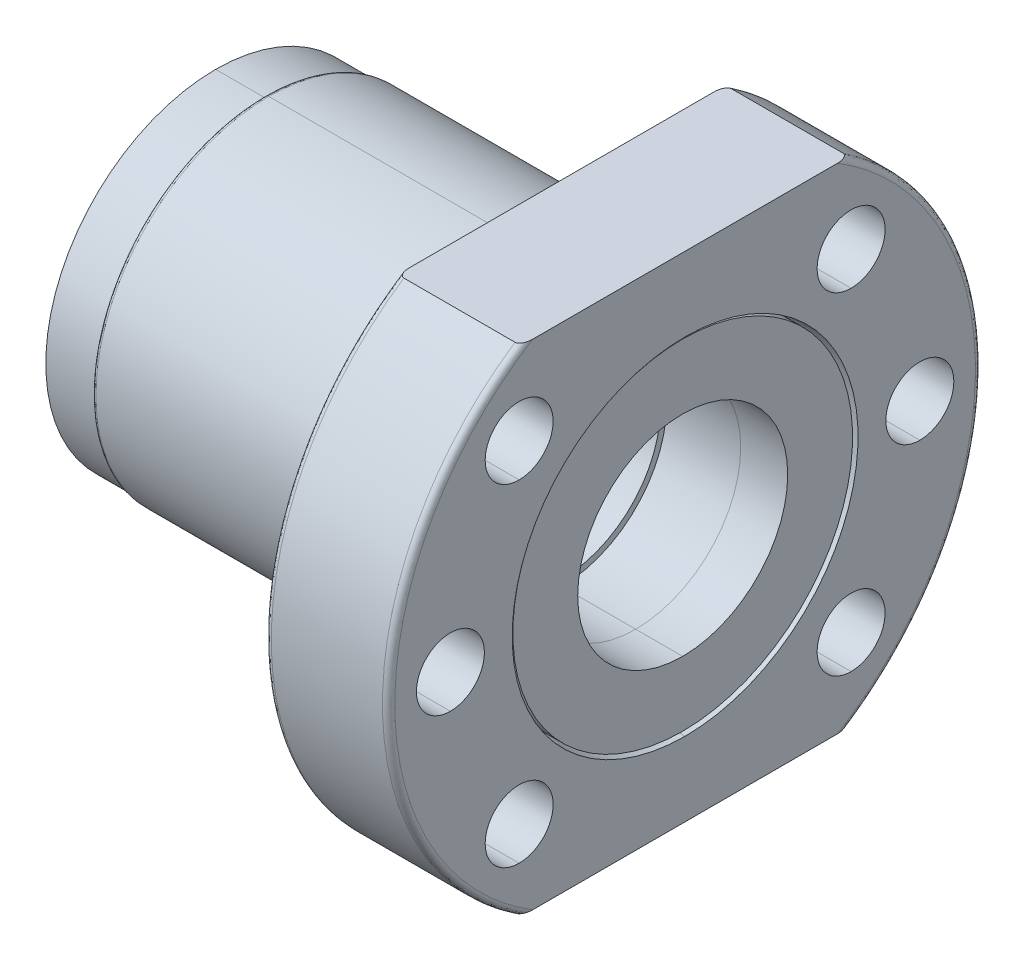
ISO-10303-21;
HEADER;
FILE_DESCRIPTION(('STEP AP214'),'2;1');
FILE_NAME('part.step','',(''),(''),'','','');
FILE_SCHEMA(('AUTOMOTIVE_DESIGN { 1 0 10303 214 1 1 1 1 }'));
ENDSEC;
DATA;
#1=APPLICATION_CONTEXT('core data for automotive mechanical design processes');
#2=APPLICATION_PROTOCOL_DEFINITION('international standard','automotive_design',2000,#1);
#3=PRODUCT_CONTEXT('',#1,'mechanical');
#4=PRODUCT('Part','Part','',(#3));
#5=PRODUCT_RELATED_PRODUCT_CATEGORY('part','',(#4));
#6=PRODUCT_DEFINITION_FORMATION('','',#4);
#7=PRODUCT_DEFINITION_CONTEXT('part definition',#1,'design');
#8=PRODUCT_DEFINITION('design','',#6,#7);
#9=PRODUCT_DEFINITION_SHAPE('','',#8);
#10=(LENGTH_UNIT() NAMED_UNIT(*) SI_UNIT(.MILLI.,.METRE.));
#11=(NAMED_UNIT(*) PLANE_ANGLE_UNIT() SI_UNIT($,.RADIAN.));
#12=(NAMED_UNIT(*) SI_UNIT($,.STERADIAN.) SOLID_ANGLE_UNIT());
#13=UNCERTAINTY_MEASURE_WITH_UNIT(LENGTH_MEASURE(1.E-05),#10,'distance_accuracy_value','');
#14=(GEOMETRIC_REPRESENTATION_CONTEXT(3) GLOBAL_UNCERTAINTY_ASSIGNED_CONTEXT((#13)) GLOBAL_UNIT_ASSIGNED_CONTEXT((#10,
#11,#12)) REPRESENTATION_CONTEXT('',''));
#15=CARTESIAN_POINT('',(0.,0.,0.));
#16=DIRECTION('',(0.,0.,1.));
#17=DIRECTION('',(1.,0.,0.));
#18=AXIS2_PLACEMENT_3D('',#15,#16,#17);
#19=CARTESIAN_POINT('',(-24.1,0.,0.));
#20=DIRECTION('',(-1.,0.,0.));
#21=DIRECTION('',(0.,0.,1.));
#22=AXIS2_PLACEMENT_3D('',#19,#20,#21);
#23=PLANE('',#22);
#24=CARTESIAN_POINT('',(-24.1,0.,0.));
#25=DIRECTION('',(-1.,0.,0.));
#26=DIRECTION('',(0.,-1.,0.));
#27=AXIS2_PLACEMENT_3D('',#24,#25,#26);
#28=CIRCLE('',#27,8.);
#29=CARTESIAN_POINT('',(-24.1,-8.,0.));
#30=VERTEX_POINT('',#29);
#31=CARTESIAN_POINT('',(-24.1,8.,0.));
#32=VERTEX_POINT('',#31);
#33=EDGE_CURVE('P0_E11',#30,#32,#28,.T.);
#34=ORIENTED_EDGE('',*,*,#33,.T.);
#35=CARTESIAN_POINT('',(-24.1,0.,0.));
#36=DIRECTION('',(-1.,0.,0.));
#37=DIRECTION('',(0.,-1.,0.));
#38=AXIS2_PLACEMENT_3D('',#35,#36,#37);
#39=CIRCLE('',#38,8.);
#40=EDGE_CURVE('P0_E688',#32,#30,#39,.T.);
#41=ORIENTED_EDGE('',*,*,#40,.T.);
#42=EDGE_LOOP('',(#34,#41));
#43=FACE_BOUND('',#42,.T.);
#44=CARTESIAN_POINT('',(-24.1,0.,0.));
#45=DIRECTION('',(1.,0.,0.));
#46=DIRECTION('',(0.,-1.,0.));
#47=AXIS2_PLACEMENT_3D('',#44,#45,#46);
#48=CIRCLE('',#47,8.5);
#49=CARTESIAN_POINT('',(-24.1,-8.5,0.));
#50=VERTEX_POINT('',#49);
#51=CARTESIAN_POINT('',(-24.1,8.5,0.));
#52=VERTEX_POINT('',#51);
#53=EDGE_CURVE('P0_E591',#50,#52,#48,.T.);
#54=ORIENTED_EDGE('',*,*,#53,.T.);
#55=CARTESIAN_POINT('',(-24.1,0.,0.));
#56=DIRECTION('',(1.,0.,0.));
#57=DIRECTION('',(0.,-1.,0.));
#58=AXIS2_PLACEMENT_3D('',#55,#56,#57);
#59=CIRCLE('',#58,8.5);
#60=EDGE_CURVE('P0_E628',#52,#50,#59,.T.);
#61=ORIENTED_EDGE('',*,*,#60,.T.);
#62=EDGE_LOOP('',(#54,#61));
#63=FACE_BOUND('',#62,.T.);
#64=ADVANCED_FACE('P0_F17',(#43,#63),#23,.F.);
#65=CARTESIAN_POINT('',(0.,0.,0.));
#66=DIRECTION('',(-1.,0.,0.));
#67=DIRECTION('',(0.,-1.,0.));
#68=AXIS2_PLACEMENT_3D('',#65,#66,#67);
#69=CYLINDRICAL_SURFACE('',#68,8.);
#70=DIRECTION('',(-1.,0.,0.));
#71=VECTOR('',#70,1.);
#72=CARTESIAN_POINT('',(0.,8.,0.));
#73=LINE('',#72,#71);
#74=CARTESIAN_POINT('',(-47.8,8.00000000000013,0.));
#75=VERTEX_POINT('',#74);
#76=EDGE_CURVE('P0_E680',#32,#75,#73,.T.);
#77=ORIENTED_EDGE('',*,*,#76,.F.);
#78=ORIENTED_EDGE('',*,*,#33,.F.);
#79=DIRECTION('',(-1.,0.,0.));
#80=VECTOR('',#79,1.);
#81=CARTESIAN_POINT('',(0.,-8.,0.));
#82=LINE('',#81,#80);
#83=CARTESIAN_POINT('',(-47.8,-7.99999999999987,0.));
#84=VERTEX_POINT('',#83);
#85=EDGE_CURVE('P0_E666',#30,#84,#82,.T.);
#86=ORIENTED_EDGE('',*,*,#85,.T.);
#87=CARTESIAN_POINT('',(-47.8,1.26123714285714E-13,0.));
#88=DIRECTION('',(-1.,0.,0.));
#89=DIRECTION('',(0.,1.,0.));
#90=AXIS2_PLACEMENT_3D('',#87,#88,#89);
#91=CIRCLE('',#90,8.);
#92=EDGE_CURVE('P0_E558',#84,#75,#91,.T.);
#93=ORIENTED_EDGE('',*,*,#92,.T.);
#94=EDGE_LOOP('',(#77,#78,#86,#93));
#95=FACE_BOUND('',#94,.T.);
#96=ADVANCED_FACE('P0_F873',(#95),#69,.F.);
#97=CARTESIAN_POINT('',(-47.8,-13.9999999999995,0.));
#98=CARTESIAN_POINT('',(-47.8,-13.9999999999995,-27.9999999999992));
#99=CARTESIAN_POINT('',(-47.7999999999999,13.9999999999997,-27.9999999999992));
#100=CARTESIAN_POINT('',(-47.8,13.9999999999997,0.));
#101=CARTESIAN_POINT('',(-47.9532322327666,-13.9999999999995,0.));
#102=CARTESIAN_POINT('',(-47.9532322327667,-13.9999999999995,-27.9999999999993));
#103=CARTESIAN_POINT('',(-47.9532322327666,13.9999999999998,-27.9999999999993));
#104=CARTESIAN_POINT('',(-47.9532322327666,13.9999999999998,0.));
#105=CARTESIAN_POINT('',(-48.0702652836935,-13.901089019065,0.));
#106=CARTESIAN_POINT('',(-48.0702652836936,-13.901089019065,-27.8021780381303));
#107=CARTESIAN_POINT('',(-48.0702652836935,13.9010890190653,-27.8021780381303));
#108=CARTESIAN_POINT('',(-48.0702652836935,13.9010890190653,0.));
#109=CARTESIAN_POINT('',(-48.0958039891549,-13.75,0.));
#110=CARTESIAN_POINT('',(-48.0958039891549,-13.75,-27.5000000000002));
#111=CARTESIAN_POINT('',(-48.0958039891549,13.7500000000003,-27.5000000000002));
#112=CARTESIAN_POINT('',(-48.0958039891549,13.7500000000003,0.));
#113=(BOUNDED_SURFACE() B_SPLINE_SURFACE(3,3,((#97,#98,#99,#100),(#101,#102,#103,#104),(#105,
#106,#107,#108),(#109,#110,#111,#112)),.UNSPECIFIED.,.F.,.F.,
.F.) B_SPLINE_SURFACE_WITH_KNOTS((4,4),(4,4),(0.,1.),(0.,1.),
.UNSPECIFIED.) GEOMETRIC_REPRESENTATION_ITEM() RATIONAL_B_SPLINE_SURFACE(((1.,0.333333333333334,
0.333333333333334,1.),(0.84250841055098,0.280836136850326,0.280836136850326,0.84250841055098),
(0.84250841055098,0.280836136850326,0.280836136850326,0.84250841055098),(1.,0.333333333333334,
0.333333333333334,1.))) REPRESENTATION_ITEM('') SURFACE());
#114=CARTESIAN_POINT('',(-47.8,1.26123714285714E-13,0.));
#115=DIRECTION('',(1.,0.,0.));
#116=DIRECTION('',(0.,1.,0.));
#117=AXIS2_PLACEMENT_3D('',#114,#115,#116);
#118=CIRCLE('',#117,13.9999999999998);
#119=CARTESIAN_POINT('',(-47.8,-13.9999999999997,0.));
#120=VERTEX_POINT('',#119);
#121=CARTESIAN_POINT('',(-47.8,14.,0.));
#122=VERTEX_POINT('',#121);
#123=EDGE_CURVE('P0_E29',#120,#122,#118,.T.);
#124=CARTESIAN_POINT('',(-47.8,-13.6999999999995,0.));
#125=DIRECTION('',(0.,0.,-1.));
#126=DIRECTION('',(0.,-1.,0.));
#127=AXIS2_PLACEMENT_3D('',#124,#125,#126);
#128=CIRCLE('',#127,0.3);
#129=CARTESIAN_POINT('',(-48.0958039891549,-13.75,0.));
#130=VERTEX_POINT('',#129);
#131=EDGE_CURVE('P0_E247',#120,#130,#128,.T.);
#132=CARTESIAN_POINT('',(-48.0958039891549,1.27514479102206E-13,0.));
#133=DIRECTION('',(1.,0.,0.));
#134=DIRECTION('',(0.,1.,0.));
#135=AXIS2_PLACEMENT_3D('',#132,#133,#134);
#136=CIRCLE('',#135,13.7500000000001);
#137=CARTESIAN_POINT('',(-48.0958039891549,13.7500000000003,0.));
#138=VERTEX_POINT('',#137);
#139=EDGE_CURVE('P0_E109',#130,#138,#136,.T.);
#140=CARTESIAN_POINT('',(-47.8,13.6999999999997,0.));
#141=DIRECTION('',(0.,0.,1.));
#142=DIRECTION('',(0.,1.,0.));
#143=AXIS2_PLACEMENT_3D('',#140,#141,#142);
#144=CIRCLE('',#143,0.3);
#145=EDGE_CURVE('P0_E251',#122,#138,#144,.T.);
#146=ORIENTED_EDGE('',*,*,#123,.F.);
#147=ORIENTED_EDGE('',*,*,#131,.T.);
#148=ORIENTED_EDGE('',*,*,#139,.T.);
#149=ORIENTED_EDGE('',*,*,#145,.F.);
#150=EDGE_LOOP('',(#146,#147,#148,#149));
#151=FACE_BOUND('',#150,.T.);
#152=ADVANCED_FACE('P0_F882',(#151),#113,.T.);
#153=CARTESIAN_POINT('',(-70.,1.847E-13,0.));
#154=DIRECTION('',(1.,0.,0.));
#155=DIRECTION('',(0.,1.,0.));
#156=AXIS2_PLACEMENT_3D('',#153,#154,#155);
#157=CYLINDRICAL_SURFACE('',#156,13.9999999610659);
#158=CARTESIAN_POINT('',(-18.1,0.,0.));
#159=DIRECTION('',(1.,0.,0.));
#160=DIRECTION('',(0.,1.,0.));
#161=AXIS2_PLACEMENT_3D('',#158,#159,#160);
#162=CIRCLE('',#161,13.9999999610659);
#163=CARTESIAN_POINT('',(-18.1,-13.9999999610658,0.));
#164=VERTEX_POINT('',#163);
#165=CARTESIAN_POINT('',(-18.1,13.9999999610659,0.));
#166=VERTEX_POINT('',#165);
#167=EDGE_CURVE('P0_E542',#164,#166,#162,.T.);
#168=ORIENTED_EDGE('',*,*,#167,.F.);
#169=DIRECTION('',(1.,0.,0.));
#170=VECTOR('',#169,1.);
#171=CARTESIAN_POINT('',(-70.,-13.9999999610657,0.));
#172=LINE('',#171,#170);
#173=CARTESIAN_POINT('',(-14.1,-13.9999999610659,0.));
#174=VERTEX_POINT('',#173);
#175=EDGE_CURVE('P0_E533',#164,#174,#172,.T.);
#176=ORIENTED_EDGE('',*,*,#175,.T.);
#177=CARTESIAN_POINT('',(-14.1,0.,0.));
#178=DIRECTION('',(-1.,0.,0.));
#179=DIRECTION('',(0.,1.,0.));
#180=AXIS2_PLACEMENT_3D('',#177,#178,#179);
#181=CIRCLE('',#180,13.9999999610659);
#182=CARTESIAN_POINT('',(-14.1,13.9999999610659,0.));
#183=VERTEX_POINT('',#182);
#184=EDGE_CURVE('P0_E143',#183,#174,#181,.T.);
#185=ORIENTED_EDGE('',*,*,#184,.F.);
#186=DIRECTION('',(1.,0.,0.));
#187=VECTOR('',#186,1.);
#188=CARTESIAN_POINT('',(-70.,13.9999999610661,0.));
#189=LINE('',#188,#187);
#190=EDGE_CURVE('P0_E524',#166,#183,#189,.T.);
#191=ORIENTED_EDGE('',*,*,#190,.F.);
#192=EDGE_LOOP('',(#168,#176,#185,#191));
#193=FACE_BOUND('',#192,.T.);
#194=ADVANCED_FACE('P0_F890',(#193),#157,.F.);
#195=CARTESIAN_POINT('',(-14.1,13.435,13.435));
#196=DIRECTION('',(-1.,0.,0.));
#197=DIRECTION('',(0.,-1.,0.));
#198=AXIS2_PLACEMENT_3D('',#195,#196,#197);
#199=CYLINDRICAL_SURFACE('',#198,2.75);
#200=CARTESIAN_POINT('',(-14.1,13.435,13.435));
#201=DIRECTION('',(-1.,0.,0.));
#202=DIRECTION('',(0.,-1.,0.));
#203=AXIS2_PLACEMENT_3D('',#200,#201,#202);
#204=CIRCLE('',#203,2.75);
#205=CARTESIAN_POINT('',(-14.1,16.185,13.435));
#206=VERTEX_POINT('',#205);
#207=CARTESIAN_POINT('',(-14.1,10.685,13.435));
#208=VERTEX_POINT('',#207);
#209=EDGE_CURVE('P0_E142',#206,#208,#204,.T.);
#210=ORIENTED_EDGE('',*,*,#209,.F.);
#211=DIRECTION('',(-1.,0.,0.));
#212=VECTOR('',#211,1.);
#213=CARTESIAN_POINT('',(-14.1,16.185,13.435));
#214=LINE('',#213,#212);
#215=CARTESIAN_POINT('',(-24.1,16.185,13.435));
#216=VERTEX_POINT('',#215);
#217=EDGE_CURVE('P0_E202',#206,#216,#214,.T.);
#218=ORIENTED_EDGE('',*,*,#217,.T.);
#219=CARTESIAN_POINT('',(-24.1,13.4350000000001,13.435));
#220=DIRECTION('',(-1.,0.,0.));
#221=DIRECTION('',(0.,-1.,0.));
#222=AXIS2_PLACEMENT_3D('',#219,#220,#221);
#223=CIRCLE('',#222,2.75);
#224=CARTESIAN_POINT('',(-24.1,10.6850000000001,13.435));
#225=VERTEX_POINT('',#224);
#226=EDGE_CURVE('P0_E260',#216,#225,#223,.T.);
#227=ORIENTED_EDGE('',*,*,#226,.T.);
#228=DIRECTION('',(-1.,0.,0.));
#229=VECTOR('',#228,1.);
#230=CARTESIAN_POINT('',(-14.1,10.685,13.435));
#231=LINE('',#230,#229);
#232=EDGE_CURVE('P0_E193',#208,#225,#231,.T.);
#233=ORIENTED_EDGE('',*,*,#232,.F.);
#234=EDGE_LOOP('',(#210,#218,#227,#233));
#235=FACE_BOUND('',#234,.T.);
#236=ADVANCED_FACE('P0_F899',(#235),#199,.F.);
#237=CARTESIAN_POINT('',(-14.1,-13.435,13.435));
#238=DIRECTION('',(-1.,0.,0.));
#239=DIRECTION('',(0.,-1.,0.));
#240=AXIS2_PLACEMENT_3D('',#237,#238,#239);
#241=CYLINDRICAL_SURFACE('',#240,2.75);
#242=CARTESIAN_POINT('',(-14.1,-13.435,13.435));
#243=DIRECTION('',(-1.,0.,0.));
#244=DIRECTION('',(0.,-1.,0.));
#245=AXIS2_PLACEMENT_3D('',#242,#243,#244);
#246=CIRCLE('',#245,2.75);
#247=CARTESIAN_POINT('',(-14.1,-10.685,13.435));
#248=VERTEX_POINT('',#247);
#249=CARTESIAN_POINT('',(-14.1,-16.185,13.435));
#250=VERTEX_POINT('',#249);
#251=EDGE_CURVE('P0_E150',#248,#250,#246,.T.);
#252=ORIENTED_EDGE('',*,*,#251,.F.);
#253=DIRECTION('',(-1.,0.,0.));
#254=VECTOR('',#253,1.);
#255=CARTESIAN_POINT('',(-14.1,-10.685,13.435));
#256=LINE('',#255,#254);
#257=CARTESIAN_POINT('',(-24.1,-10.6849999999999,13.435));
#258=VERTEX_POINT('',#257);
#259=EDGE_CURVE('P0_E192',#248,#258,#256,.T.);
#260=ORIENTED_EDGE('',*,*,#259,.T.);
#261=CARTESIAN_POINT('',(-24.1,-13.4349999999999,13.435));
#262=DIRECTION('',(-1.,0.,0.));
#263=DIRECTION('',(0.,-1.,0.));
#264=AXIS2_PLACEMENT_3D('',#261,#262,#263);
#265=CIRCLE('',#264,2.75);
#266=CARTESIAN_POINT('',(-24.1,-16.185,13.435));
#267=VERTEX_POINT('',#266);
#268=EDGE_CURVE('P0_E264',#258,#267,#265,.T.);
#269=ORIENTED_EDGE('',*,*,#268,.T.);
#270=DIRECTION('',(-1.,0.,0.));
#271=VECTOR('',#270,1.);
#272=CARTESIAN_POINT('',(-14.1,-16.185,13.435));
#273=LINE('',#272,#271);
#274=EDGE_CURVE('P0_E209',#250,#267,#273,.T.);
#275=ORIENTED_EDGE('',*,*,#274,.F.);
#276=EDGE_LOOP('',(#252,#260,#269,#275));
#277=FACE_BOUND('',#276,.T.);
#278=ADVANCED_FACE('P0_F908',(#277),#241,.F.);
#279=CARTESIAN_POINT('',(-14.1,-13.435,-13.435));
#280=DIRECTION('',(-1.,0.,0.));
#281=DIRECTION('',(0.,-1.,0.));
#282=AXIS2_PLACEMENT_3D('',#279,#280,#281);
#283=CYLINDRICAL_SURFACE('',#282,2.75);
#284=CARTESIAN_POINT('',(-14.1,-13.435,-13.435));
#285=DIRECTION('',(-1.,0.,0.));
#286=DIRECTION('',(0.,-1.,0.));
#287=AXIS2_PLACEMENT_3D('',#284,#285,#286);
#288=CIRCLE('',#287,2.75);
#289=CARTESIAN_POINT('',(-14.1,-10.685,-13.435));
#290=VERTEX_POINT('',#289);
#291=CARTESIAN_POINT('',(-14.1,-16.185,-13.435));
#292=VERTEX_POINT('',#291);
#293=EDGE_CURVE('P0_E164',#290,#292,#288,.T.);
#294=ORIENTED_EDGE('',*,*,#293,.F.);
#295=DIRECTION('',(-1.,0.,0.));
#296=VECTOR('',#295,1.);
#297=CARTESIAN_POINT('',(-14.1,-10.685,-13.435));
#298=LINE('',#297,#296);
#299=CARTESIAN_POINT('',(-24.1,-10.6849999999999,-13.435));
#300=VERTEX_POINT('',#299);
#301=EDGE_CURVE('P0_E217',#290,#300,#298,.T.);
#302=ORIENTED_EDGE('',*,*,#301,.T.);
#303=CARTESIAN_POINT('',(-24.1,-13.4349999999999,-13.435));
#304=DIRECTION('',(-1.,0.,0.));
#305=DIRECTION('',(0.,-1.,0.));
#306=AXIS2_PLACEMENT_3D('',#303,#304,#305);
#307=CIRCLE('',#306,2.75);
#308=CARTESIAN_POINT('',(-24.1,-16.185,-13.435));
#309=VERTEX_POINT('',#308);
#310=EDGE_CURVE('P0_E268',#300,#309,#307,.T.);
#311=ORIENTED_EDGE('',*,*,#310,.T.);
#312=DIRECTION('',(-1.,0.,0.));
#313=VECTOR('',#312,1.);
#314=CARTESIAN_POINT('',(-14.1,-16.185,-13.435));
#315=LINE('',#314,#313);
#316=EDGE_CURVE('P0_E218',#292,#309,#315,.T.);
#317=ORIENTED_EDGE('',*,*,#316,.F.);
#318=EDGE_LOOP('',(#294,#302,#311,#317));
#319=FACE_BOUND('',#318,.T.);
#320=ADVANCED_FACE('P0_F914',(#319),#283,.F.);
#321=CARTESIAN_POINT('',(-14.1,13.435,-13.435));
#322=DIRECTION('',(-1.,0.,0.));
#323=DIRECTION('',(0.,-1.,0.));
#324=AXIS2_PLACEMENT_3D('',#321,#322,#323);
#325=CYLINDRICAL_SURFACE('',#324,2.75);
#326=CARTESIAN_POINT('',(-14.1,13.435,-13.435));
#327=DIRECTION('',(-1.,0.,0.));
#328=DIRECTION('',(0.,-1.,0.));
#329=AXIS2_PLACEMENT_3D('',#326,#327,#328);
#330=CIRCLE('',#329,2.75);
#331=CARTESIAN_POINT('',(-14.1,16.185,-13.435));
#332=VERTEX_POINT('',#331);
#333=CARTESIAN_POINT('',(-14.1,10.685,-13.435));
#334=VERTEX_POINT('',#333);
#335=EDGE_CURVE('P0_E170',#332,#334,#330,.T.);
#336=ORIENTED_EDGE('',*,*,#335,.F.);
#337=DIRECTION('',(-1.,0.,0.));
#338=VECTOR('',#337,1.);
#339=CARTESIAN_POINT('',(-14.1,16.185,-13.435));
#340=LINE('',#339,#338);
#341=CARTESIAN_POINT('',(-24.1,16.185,-13.435));
#342=VERTEX_POINT('',#341);
#343=EDGE_CURVE('P0_E152',#332,#342,#340,.T.);
#344=ORIENTED_EDGE('',*,*,#343,.T.);
#345=CARTESIAN_POINT('',(-24.1,13.4350000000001,-13.435));
#346=DIRECTION('',(-1.,0.,0.));
#347=DIRECTION('',(0.,-1.,0.));
#348=AXIS2_PLACEMENT_3D('',#345,#346,#347);
#349=CIRCLE('',#348,2.75);
#350=CARTESIAN_POINT('',(-24.1,10.6850000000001,-13.435));
#351=VERTEX_POINT('',#350);
#352=EDGE_CURVE('P0_E272',#342,#351,#349,.T.);
#353=ORIENTED_EDGE('',*,*,#352,.T.);
#354=DIRECTION('',(-1.,0.,0.));
#355=VECTOR('',#354,1.);
#356=CARTESIAN_POINT('',(-14.1,10.685,-13.435));
#357=LINE('',#356,#355);
#358=EDGE_CURVE('P0_E156',#334,#351,#357,.T.);
#359=ORIENTED_EDGE('',*,*,#358,.F.);
#360=EDGE_LOOP('',(#336,#344,#353,#359));
#361=FACE_BOUND('',#360,.T.);
#362=ADVANCED_FACE('P0_F918',(#361),#325,.F.);
#363=CARTESIAN_POINT('',(-14.1,0.,19.));
#364=DIRECTION('',(-1.,0.,0.));
#365=DIRECTION('',(0.,-1.,0.));
#366=AXIS2_PLACEMENT_3D('',#363,#364,#365);
#367=CYLINDRICAL_SURFACE('',#366,2.75);
#368=CARTESIAN_POINT('',(-14.1,0.,19.));
#369=DIRECTION('',(-1.,0.,0.));
#370=DIRECTION('',(0.,-1.,0.));
#371=AXIS2_PLACEMENT_3D('',#368,#369,#370);
#372=CIRCLE('',#371,2.75);
#373=CARTESIAN_POINT('',(-14.1,2.75000000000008,19.));
#374=VERTEX_POINT('',#373);
#375=CARTESIAN_POINT('',(-14.1,-2.74999999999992,19.));
#376=VERTEX_POINT('',#375);
#377=EDGE_CURVE('P0_E183',#374,#376,#372,.T.);
#378=ORIENTED_EDGE('',*,*,#377,.F.);
#379=DIRECTION('',(-1.,0.,0.));
#380=VECTOR('',#379,1.);
#381=CARTESIAN_POINT('',(-14.1,2.75000000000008,19.));
#382=LINE('',#381,#380);
#383=CARTESIAN_POINT('',(-24.1,2.7500000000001,19.));
#384=VERTEX_POINT('',#383);
#385=EDGE_CURVE('P0_E175',#374,#384,#382,.T.);
#386=ORIENTED_EDGE('',*,*,#385,.T.);
#387=CARTESIAN_POINT('',(-24.1,1.01304084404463E-13,19.));
#388=DIRECTION('',(-1.,0.,0.));
#389=DIRECTION('',(0.,-1.,0.));
#390=AXIS2_PLACEMENT_3D('',#387,#388,#389);
#391=CIRCLE('',#390,2.75);
#392=CARTESIAN_POINT('',(-24.1,-2.7499999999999,19.));
#393=VERTEX_POINT('',#392);
#394=EDGE_CURVE('P0_E132',#384,#393,#391,.T.);
#395=ORIENTED_EDGE('',*,*,#394,.T.);
#396=DIRECTION('',(-1.,0.,0.));
#397=VECTOR('',#396,1.);
#398=CARTESIAN_POINT('',(-14.1,-2.74999999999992,19.));
#399=LINE('',#398,#397);
#400=EDGE_CURVE('P0_E171',#376,#393,#399,.T.);
#401=ORIENTED_EDGE('',*,*,#400,.F.);
#402=EDGE_LOOP('',(#378,#386,#395,#401));
#403=FACE_BOUND('',#402,.T.);
#404=ADVANCED_FACE('P0_F927',(#403),#367,.F.);
#405=CARTESIAN_POINT('',(-14.1,0.,-19.));
#406=DIRECTION('',(-1.,0.,0.));
#407=DIRECTION('',(0.,-1.,0.));
#408=AXIS2_PLACEMENT_3D('',#405,#406,#407);
#409=CYLINDRICAL_SURFACE('',#408,2.75);
#410=CARTESIAN_POINT('',(-14.1,0.,-19.));
#411=DIRECTION('',(-1.,0.,0.));
#412=DIRECTION('',(0.,-1.,0.));
#413=AXIS2_PLACEMENT_3D('',#410,#411,#412);
#414=CIRCLE('',#413,2.75);
#415=CARTESIAN_POINT('',(-14.1,2.75000000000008,-19.));
#416=VERTEX_POINT('',#415);
#417=CARTESIAN_POINT('',(-14.1,-2.74999999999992,-19.));
#418=VERTEX_POINT('',#417);
#419=EDGE_CURVE('P0_E197',#416,#418,#414,.T.);
#420=ORIENTED_EDGE('',*,*,#419,.F.);
#421=DIRECTION('',(-1.,0.,0.));
#422=VECTOR('',#421,1.);
#423=CARTESIAN_POINT('',(-14.1,2.75000000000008,-19.));
#424=LINE('',#423,#422);
#425=CARTESIAN_POINT('',(-24.1,2.7500000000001,-19.));
#426=VERTEX_POINT('',#425);
#427=EDGE_CURVE('P0_E234',#416,#426,#424,.T.);
#428=ORIENTED_EDGE('',*,*,#427,.T.);
#429=CARTESIAN_POINT('',(-24.1,1.04231430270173E-13,-19.));
#430=DIRECTION('',(-1.,0.,0.));
#431=DIRECTION('',(0.,-1.,0.));
#432=AXIS2_PLACEMENT_3D('',#429,#430,#431);
#433=CIRCLE('',#432,2.75);
#434=CARTESIAN_POINT('',(-24.1,-2.74999999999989,-19.));
#435=VERTEX_POINT('',#434);
#436=EDGE_CURVE('P0_E126',#426,#435,#433,.T.);
#437=ORIENTED_EDGE('',*,*,#436,.T.);
#438=DIRECTION('',(-1.,0.,0.));
#439=VECTOR('',#438,1.);
#440=CARTESIAN_POINT('',(-14.1,-2.74999999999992,-19.));
#441=LINE('',#440,#439);
#442=EDGE_CURVE('P0_E238',#418,#435,#441,.T.);
#443=ORIENTED_EDGE('',*,*,#442,.F.);
#444=EDGE_LOOP('',(#420,#428,#437,#443));
#445=FACE_BOUND('',#444,.T.);
#446=ADVANCED_FACE('P0_F437',(#445),#409,.F.);
#447=CARTESIAN_POINT('',(-47.8,1.26123714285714E-13,0.));
#448=DIRECTION('',(1.,0.,0.));
#449=DIRECTION('',(0.,1.,0.));
#450=AXIS2_PLACEMENT_3D('',#447,#448,#449);
#451=CYLINDRICAL_SURFACE('',#450,13.9999999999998);
#452=DIRECTION('',(1.,0.,0.));
#453=VECTOR('',#452,1.);
#454=CARTESIAN_POINT('',(-47.8,-13.9999999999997,0.));
#455=LINE('',#454,#453);
#456=CARTESIAN_POINT('',(-24.1,-13.9999999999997,0.));
#457=VERTEX_POINT('',#456);
#458=EDGE_CURVE('P0_E650',#120,#457,#455,.T.);
#459=ORIENTED_EDGE('',*,*,#458,.F.);
#460=ORIENTED_EDGE('',*,*,#123,.T.);
#461=DIRECTION('',(1.,0.,0.));
#462=VECTOR('',#461,1.);
#463=CARTESIAN_POINT('',(-47.8,14.,0.));
#464=LINE('',#463,#462);
#465=CARTESIAN_POINT('',(-24.1,13.9999999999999,0.));
#466=VERTEX_POINT('',#465);
#467=EDGE_CURVE('P0_E636',#122,#466,#464,.T.);
#468=ORIENTED_EDGE('',*,*,#467,.T.);
#469=CARTESIAN_POINT('',(-24.1,0.,0.));
#470=DIRECTION('',(-1.,0.,0.));
#471=DIRECTION('',(0.,1.,0.));
#472=AXIS2_PLACEMENT_3D('',#469,#470,#471);
#473=CIRCLE('',#472,13.9999999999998);
#474=EDGE_CURVE('P0_E259',#466,#457,#473,.T.);
#475=ORIENTED_EDGE('',*,*,#474,.T.);
#476=EDGE_LOOP('',(#459,#460,#468,#475));
#477=FACE_BOUND('',#476,.T.);
#478=ADVANCED_FACE('P0_F941',(#477),#451,.T.);
#479=CARTESIAN_POINT('',(-70.,1.847E-13,0.));
#480=DIRECTION('',(1.,0.,0.));
#481=DIRECTION('',(0.,1.,0.));
#482=AXIS2_PLACEMENT_3D('',#479,#480,#481);
#483=CYLINDRICAL_SURFACE('',#482,8.5);
#484=CARTESIAN_POINT('',(-52.1,1.37469571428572E-13,0.));
#485=DIRECTION('',(-1.,0.,0.));
#486=DIRECTION('',(0.,-1.,0.));
#487=AXIS2_PLACEMENT_3D('',#484,#485,#486);
#488=CIRCLE('',#487,8.5);
#489=CARTESIAN_POINT('',(-52.1,8.50000000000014,0.));
#490=VERTEX_POINT('',#489);
#491=CARTESIAN_POINT('',(-52.1,-8.49999999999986,0.));
#492=VERTEX_POINT('',#491);
#493=EDGE_CURVE('P0_E122',#490,#492,#488,.T.);
#494=ORIENTED_EDGE('',*,*,#493,.T.);
#495=DIRECTION('',(1.,0.,0.));
#496=VECTOR('',#495,1.);
#497=CARTESIAN_POINT('',(-70.,-8.49999999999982,0.));
#498=LINE('',#497,#496);
#499=CARTESIAN_POINT('',(-47.8,-8.49999999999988,0.));
#500=VERTEX_POINT('',#499);
#501=EDGE_CURVE('P0_E43',#492,#500,#498,.T.);
#502=ORIENTED_EDGE('',*,*,#501,.T.);
#503=CARTESIAN_POINT('',(-47.8,1.26123714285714E-13,0.));
#504=DIRECTION('',(-1.,0.,0.));
#505=DIRECTION('',(0.,1.,0.));
#506=AXIS2_PLACEMENT_3D('',#503,#504,#505);
#507=CIRCLE('',#506,8.5);
#508=CARTESIAN_POINT('',(-47.8,8.50000000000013,0.));
#509=VERTEX_POINT('',#508);
#510=EDGE_CURVE('P0_E573',#509,#500,#507,.T.);
#511=ORIENTED_EDGE('',*,*,#510,.F.);
#512=DIRECTION('',(1.,0.,0.));
#513=VECTOR('',#512,1.);
#514=CARTESIAN_POINT('',(-70.,8.50000000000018,0.));
#515=LINE('',#514,#513);
#516=EDGE_CURVE('P0_E284',#490,#509,#515,.T.);
#517=ORIENTED_EDGE('',*,*,#516,.F.);
#518=EDGE_LOOP('',(#494,#502,#511,#517));
#519=FACE_BOUND('',#518,.T.);
#520=ADVANCED_FACE('P0_F945',(#519),#483,.F.);
#521=CARTESIAN_POINT('',(-70.,1.847E-13,0.));
#522=DIRECTION('',(1.,0.,0.));
#523=DIRECTION('',(0.,1.,0.));
#524=AXIS2_PLACEMENT_3D('',#521,#522,#523);
#525=CYLINDRICAL_SURFACE('',#524,13.7499999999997);
#526=CARTESIAN_POINT('',(-52.1,1.37469571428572E-13,0.));
#527=DIRECTION('',(-1.,0.,0.));
#528=DIRECTION('',(0.,-1.,0.));
#529=AXIS2_PLACEMENT_3D('',#526,#527,#528);
#530=CIRCLE('',#529,13.7499999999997);
#531=CARTESIAN_POINT('',(-52.1,-13.7499999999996,0.));
#532=VERTEX_POINT('',#531);
#533=CARTESIAN_POINT('',(-52.1,13.7499999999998,0.));
#534=VERTEX_POINT('',#533);
#535=EDGE_CURVE('P0_E118',#532,#534,#530,.T.);
#536=ORIENTED_EDGE('',*,*,#535,.F.);
#537=DIRECTION('',(1.,0.,0.));
#538=VECTOR('',#537,1.);
#539=CARTESIAN_POINT('',(-70.,-13.7499999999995,0.));
#540=LINE('',#539,#538);
#541=EDGE_CURVE('P0_E102',#532,#130,#540,.T.);
#542=ORIENTED_EDGE('',*,*,#541,.T.);
#543=CARTESIAN_POINT('',(-48.0958039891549,1.27514479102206E-13,0.));
#544=DIRECTION('',(1.,0.,0.));
#545=DIRECTION('',(0.,1.,0.));
#546=AXIS2_PLACEMENT_3D('',#543,#544,#545);
#547=CIRCLE('',#546,13.7500000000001);
#548=EDGE_CURVE('P0_E256',#138,#130,#547,.T.);
#549=ORIENTED_EDGE('',*,*,#548,.F.);
#550=DIRECTION('',(1.,0.,0.));
#551=VECTOR('',#550,1.);
#552=CARTESIAN_POINT('',(-70.,13.75,0.));
#553=LINE('',#552,#551);
#554=EDGE_CURVE('P0_E114',#534,#138,#553,.T.);
#555=ORIENTED_EDGE('',*,*,#554,.F.);
#556=EDGE_LOOP('',(#536,#542,#549,#555));
#557=FACE_BOUND('',#556,.T.);
#558=ADVANCED_FACE('P0_F119',(#557),#525,.T.);
#559=CARTESIAN_POINT('',(-70.,1.847E-13,0.));
#560=DIRECTION('',(1.,0.,0.));
#561=DIRECTION('',(0.,1.,0.));
#562=AXIS2_PLACEMENT_3D('',#559,#560,#561);
#563=CYLINDRICAL_SURFACE('',#562,8.5);
#564=ORIENTED_EDGE('',*,*,#501,.F.);
#565=CARTESIAN_POINT('',(-52.1,1.37469571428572E-13,0.));
#566=DIRECTION('',(-1.,0.,0.));
#567=DIRECTION('',(0.,-1.,0.));
#568=AXIS2_PLACEMENT_3D('',#565,#566,#567);
#569=CIRCLE('',#568,8.5);
#570=EDGE_CURVE('P0_E115',#492,#490,#569,.T.);
#571=ORIENTED_EDGE('',*,*,#570,.T.);
#572=ORIENTED_EDGE('',*,*,#516,.T.);
#573=CARTESIAN_POINT('',(-47.8,1.26123714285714E-13,0.));
#574=DIRECTION('',(-1.,0.,0.));
#575=DIRECTION('',(0.,1.,0.));
#576=AXIS2_PLACEMENT_3D('',#573,#574,#575);
#577=CIRCLE('',#576,8.5);
#578=EDGE_CURVE('P0_E565',#500,#509,#577,.T.);
#579=ORIENTED_EDGE('',*,*,#578,.F.);
#580=EDGE_LOOP('',(#564,#571,#572,#579));
#581=FACE_BOUND('',#580,.T.);
#582=ADVANCED_FACE('P0_F962',(#581),#563,.F.);
#583=CARTESIAN_POINT('',(-70.,1.847E-13,0.));
#584=DIRECTION('',(1.,0.,0.));
#585=DIRECTION('',(0.,1.,0.));
#586=AXIS2_PLACEMENT_3D('',#583,#584,#585);
#587=CYLINDRICAL_SURFACE('',#586,13.7499999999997);
#588=ORIENTED_EDGE('',*,*,#541,.F.);
#589=CARTESIAN_POINT('',(-52.1,1.37469571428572E-13,0.));
#590=DIRECTION('',(-1.,0.,0.));
#591=DIRECTION('',(0.,-1.,0.));
#592=AXIS2_PLACEMENT_3D('',#589,#590,#591);
#593=CIRCLE('',#592,13.7499999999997);
#594=EDGE_CURVE('P0_E107',#534,#532,#593,.T.);
#595=ORIENTED_EDGE('',*,*,#594,.F.);
#596=ORIENTED_EDGE('',*,*,#554,.T.);
#597=ORIENTED_EDGE('',*,*,#139,.F.);
#598=EDGE_LOOP('',(#588,#595,#596,#597));
#599=FACE_BOUND('',#598,.T.);
#600=ADVANCED_FACE('P0_F104',(#599),#587,.T.);
#601=CARTESIAN_POINT('',(-52.1,1.37469571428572E-13,0.));
#602=DIRECTION('',(-1.,0.,0.));
#603=DIRECTION('',(0.,0.,1.));
#604=AXIS2_PLACEMENT_3D('',#601,#602,#603);
#605=PLANE('',#604);
#606=ORIENTED_EDGE('',*,*,#493,.F.);
#607=ORIENTED_EDGE('',*,*,#570,.F.);
#608=EDGE_LOOP('',(#606,#607));
#609=FACE_BOUND('',#608,.T.);
#610=ORIENTED_EDGE('',*,*,#594,.T.);
#611=ORIENTED_EDGE('',*,*,#535,.T.);
#612=EDGE_LOOP('',(#610,#611));
#613=FACE_BOUND('',#612,.T.);
#614=ADVANCED_FACE('P0_F124',(#609,#613),#605,.T.);
#615=CARTESIAN_POINT('',(-24.1,18.75,0.));
#616=DIRECTION('',(1.,0.,0.));
#617=DIRECTION('',(0.,-1.,0.));
#618=AXIS2_PLACEMENT_3D('',#615,#616,#617);
#619=PLANE('',#618);
#620=CARTESIAN_POINT('',(-24.1,1.04231430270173E-13,-19.));
#621=DIRECTION('',(-1.,0.,0.));
#622=DIRECTION('',(0.,-1.,0.));
#623=AXIS2_PLACEMENT_3D('',#620,#621,#622);
#624=CIRCLE('',#623,2.75);
#625=EDGE_CURVE('P0_E242',#435,#426,#624,.T.);
#626=ORIENTED_EDGE('',*,*,#625,.F.);
#627=ORIENTED_EDGE('',*,*,#436,.F.);
#628=EDGE_LOOP('',(#626,#627));
#629=FACE_BOUND('',#628,.T.);
#630=CARTESIAN_POINT('',(-24.1,1.01304084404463E-13,19.));
#631=DIRECTION('',(-1.,0.,0.));
#632=DIRECTION('',(0.,-1.,0.));
#633=AXIS2_PLACEMENT_3D('',#630,#631,#632);
#634=CIRCLE('',#633,2.75);
#635=EDGE_CURVE('P0_E135',#393,#384,#634,.T.);
#636=ORIENTED_EDGE('',*,*,#635,.F.);
#637=ORIENTED_EDGE('',*,*,#394,.F.);
#638=EDGE_LOOP('',(#636,#637));
#639=FACE_BOUND('',#638,.T.);
#640=CARTESIAN_POINT('',(-24.1,13.4350000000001,-13.435));
#641=DIRECTION('',(-1.,0.,0.));
#642=DIRECTION('',(0.,-1.,0.));
#643=AXIS2_PLACEMENT_3D('',#640,#641,#642);
#644=CIRCLE('',#643,2.75);
#645=EDGE_CURVE('P0_E225',#351,#342,#644,.T.);
#646=ORIENTED_EDGE('',*,*,#645,.F.);
#647=ORIENTED_EDGE('',*,*,#352,.F.);
#648=EDGE_LOOP('',(#646,#647));
#649=FACE_BOUND('',#648,.T.);
#650=CARTESIAN_POINT('',(-24.1,-13.4349999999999,-13.435));
#651=DIRECTION('',(-1.,0.,0.));
#652=DIRECTION('',(0.,-1.,0.));
#653=AXIS2_PLACEMENT_3D('',#650,#651,#652);
#654=CIRCLE('',#653,2.75);
#655=EDGE_CURVE('P0_E157',#309,#300,#654,.T.);
#656=ORIENTED_EDGE('',*,*,#655,.F.);
#657=ORIENTED_EDGE('',*,*,#310,.F.);
#658=EDGE_LOOP('',(#656,#657));
#659=FACE_BOUND('',#658,.T.);
#660=CARTESIAN_POINT('',(-24.1,-13.4349999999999,13.435));
#661=DIRECTION('',(-1.,0.,0.));
#662=DIRECTION('',(0.,-1.,0.));
#663=AXIS2_PLACEMENT_3D('',#660,#661,#662);
#664=CIRCLE('',#663,2.75);
#665=EDGE_CURVE('P0_E213',#267,#258,#664,.T.);
#666=ORIENTED_EDGE('',*,*,#665,.F.);
#667=ORIENTED_EDGE('',*,*,#268,.F.);
#668=EDGE_LOOP('',(#666,#667));
#669=FACE_BOUND('',#668,.T.);
#670=CARTESIAN_POINT('',(-24.1,13.4350000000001,13.435));
#671=DIRECTION('',(-1.,0.,0.));
#672=DIRECTION('',(0.,-1.,0.));
#673=AXIS2_PLACEMENT_3D('',#670,#671,#672);
#674=CIRCLE('',#673,2.75);
#675=EDGE_CURVE('P0_E188',#225,#216,#674,.T.);
#676=ORIENTED_EDGE('',*,*,#675,.F.);
#677=ORIENTED_EDGE('',*,*,#226,.F.);
#678=EDGE_LOOP('',(#676,#677));
#679=FACE_BOUND('',#678,.T.);
#680=ORIENTED_EDGE('',*,*,#474,.F.);
#681=CARTESIAN_POINT('',(-24.1,0.,0.));
#682=DIRECTION('',(-1.,0.,0.));
#683=DIRECTION('',(0.,1.,0.));
#684=AXIS2_PLACEMENT_3D('',#681,#682,#683);
#685=CIRCLE('',#684,13.9999999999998);
#686=EDGE_CURVE('P0_E643',#457,#466,#685,.T.);
#687=ORIENTED_EDGE('',*,*,#686,.F.);
#688=EDGE_LOOP('',(#680,#687));
#689=FACE_BOUND('',#688,.T.);
#690=DIRECTION('',(0.,0.,-1.));
#691=VECTOR('',#690,1.);
#692=CARTESIAN_POINT('',(-24.1,-20.,0.));
#693=LINE('',#692,#691);
#694=CARTESIAN_POINT('',(-24.1,-20.,12.3389626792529));
#695=VERTEX_POINT('',#694);
#696=CARTESIAN_POINT('',(-24.1,-20.,-12.338962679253));
#697=VERTEX_POINT('',#696);
#698=EDGE_CURVE('P0_E1250',#695,#697,#693,.T.);
#699=ORIENTED_EDGE('',*,*,#698,.F.);
#700=CARTESIAN_POINT('',(-24.1,20.,12.3389626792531));
#701=CARTESIAN_POINT('',(-24.0999999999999,9.75550517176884,28.9440778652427));
#702=CARTESIAN_POINT('',(-24.1,-9.75550517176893,28.9440778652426));
#703=CARTESIAN_POINT('',(-24.1,-20.,12.3389626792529));
#704=(BOUNDED_CURVE() B_SPLINE_CURVE(3,(#700,#701,#702,#703),.UNSPECIFIED.,.F.,
.F.) B_SPLINE_CURVE_WITH_KNOTS((4,4),(0.,1.),
.UNSPECIFIED.) CURVE() GEOMETRIC_REPRESENTATION_ITEM() RATIONAL_B_SPLINE_CURVE((1.,
0.683374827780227,0.683374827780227,1.)) REPRESENTATION_ITEM(''));
#705=CARTESIAN_POINT('',(-24.1,20.,12.3389626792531));
#706=VERTEX_POINT('',#705);
#707=EDGE_CURVE('P0_E1262',#706,#695,#704,.T.);
#708=ORIENTED_EDGE('',*,*,#707,.F.);
#709=DIRECTION('',(0.,0.,1.));
#710=VECTOR('',#709,1.);
#711=CARTESIAN_POINT('',(-24.1,20.,0.));
#712=LINE('',#711,#710);
#713=CARTESIAN_POINT('',(-24.1,20.,-12.3389626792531));
#714=VERTEX_POINT('',#713);
#715=EDGE_CURVE('P0_E1234',#714,#706,#712,.T.);
#716=ORIENTED_EDGE('',*,*,#715,.F.);
#717=CARTESIAN_POINT('',(-24.1,-20.,-12.338962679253));
#718=CARTESIAN_POINT('',(-24.0999999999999,-9.75550517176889,-28.9440778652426));
#719=CARTESIAN_POINT('',(-24.0999999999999,9.75550517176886,-28.9440778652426));
#720=CARTESIAN_POINT('',(-24.1,20.,-12.3389626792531));
#721=(BOUNDED_CURVE() B_SPLINE_CURVE(3,(#717,#718,#719,#720),.UNSPECIFIED.,.F.,
.F.) B_SPLINE_CURVE_WITH_KNOTS((4,4),(0.,1.),
.UNSPECIFIED.) CURVE() GEOMETRIC_REPRESENTATION_ITEM() RATIONAL_B_SPLINE_CURVE((1.,
0.683374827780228,0.683374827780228,1.)) REPRESENTATION_ITEM(''));
#722=EDGE_CURVE('P0_E252',#697,#714,#721,.T.);
#723=ORIENTED_EDGE('',*,*,#722,.F.);
#724=EDGE_LOOP('',(#699,#708,#716,#723));
#725=FACE_BOUND('',#724,.T.);
#726=ADVANCED_FACE('P0_F981',(#629,#639,#649,#659,#669,#679,#689,#725),#619,.F.);
#727=CARTESIAN_POINT('',(-47.8,13.9999999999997,0.));
#728=CARTESIAN_POINT('',(-47.7999999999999,13.9999999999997,27.9999999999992));
#729=CARTESIAN_POINT('',(-47.8,-13.9999999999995,27.9999999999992));
#730=CARTESIAN_POINT('',(-47.8,-13.9999999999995,0.));
#731=CARTESIAN_POINT('',(-47.9532322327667,13.9999999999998,0.));
#732=CARTESIAN_POINT('',(-47.9532322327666,13.9999999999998,27.9999999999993));
#733=CARTESIAN_POINT('',(-47.9532322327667,-13.9999999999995,27.9999999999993));
#734=CARTESIAN_POINT('',(-47.9532322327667,-13.9999999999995,0.));
#735=CARTESIAN_POINT('',(-48.0702652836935,13.9010890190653,0.));
#736=CARTESIAN_POINT('',(-48.0702652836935,13.9010890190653,27.8021780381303));
#737=CARTESIAN_POINT('',(-48.0702652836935,-13.901089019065,27.8021780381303));
#738=CARTESIAN_POINT('',(-48.0702652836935,-13.901089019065,0.));
#739=CARTESIAN_POINT('',(-48.0958039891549,13.7500000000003,0.));
#740=CARTESIAN_POINT('',(-48.0958039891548,13.7500000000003,27.5000000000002));
#741=CARTESIAN_POINT('',(-48.0958039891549,-13.75,27.5000000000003));
#742=CARTESIAN_POINT('',(-48.0958039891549,-13.75,0.));
#743=(BOUNDED_SURFACE() B_SPLINE_SURFACE(3,3,((#727,#728,#729,#730),(#731,#732,#733,#734),(#735,
#736,#737,#738),(#739,#740,#741,#742)),.UNSPECIFIED.,.F.,.F.,
.F.) B_SPLINE_SURFACE_WITH_KNOTS((4,4),(4,4),(0.,1.),(0.,1.),
.UNSPECIFIED.) GEOMETRIC_REPRESENTATION_ITEM() RATIONAL_B_SPLINE_SURFACE(((1.,0.333333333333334,
0.333333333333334,1.),(0.842508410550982,0.280836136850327,0.280836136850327,0.842508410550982),
(0.842508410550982,0.280836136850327,0.280836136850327,0.842508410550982),(1.,0.333333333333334,
0.333333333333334,1.))) REPRESENTATION_ITEM('') SURFACE());
#744=CARTESIAN_POINT('',(-47.8,1.26123714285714E-13,0.));
#745=DIRECTION('',(1.,0.,0.));
#746=DIRECTION('',(0.,1.,0.));
#747=AXIS2_PLACEMENT_3D('',#744,#745,#746);
#748=CIRCLE('',#747,13.9999999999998);
#749=EDGE_CURVE('P0_E657',#122,#120,#748,.T.);
#750=ORIENTED_EDGE('',*,*,#131,.F.);
#751=ORIENTED_EDGE('',*,*,#749,.F.);
#752=ORIENTED_EDGE('',*,*,#145,.T.);
#753=ORIENTED_EDGE('',*,*,#548,.T.);
#754=EDGE_LOOP('',(#750,#751,#752,#753));
#755=FACE_BOUND('',#754,.T.);
#756=ADVANCED_FACE('P0_F316',(#755),#743,.T.);
#757=CARTESIAN_POINT('',(-23.6,-20.5779450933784,-12.3510394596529));
#758=CARTESIAN_POINT('',(-23.5999999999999,-10.1406488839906,-29.7405157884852));
#759=CARTESIAN_POINT('',(-23.5999999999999,10.1406488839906,-29.7405157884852));
#760=CARTESIAN_POINT('',(-23.6,20.5779450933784,-12.351039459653));
#761=CARTESIAN_POINT('',(-23.8928932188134,-20.5779450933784,-12.3510394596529));
#762=CARTESIAN_POINT('',(-23.8928932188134,-10.1406488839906,-29.7405157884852));
#763=CARTESIAN_POINT('',(-23.8928932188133,10.1406488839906,-29.7405157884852));
#764=CARTESIAN_POINT('',(-23.8928932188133,20.5779450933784,-12.351039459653));
#765=CARTESIAN_POINT('',(-24.1,-20.4003687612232,-12.2444567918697));
#766=CARTESIAN_POINT('',(-24.0999999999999,-10.0531406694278,-29.4838715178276));
#767=CARTESIAN_POINT('',(-24.0999999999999,10.0531406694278,-29.4838715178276));
#768=CARTESIAN_POINT('',(-24.0999999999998,20.4003687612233,-12.2444567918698));
#769=CARTESIAN_POINT('',(-24.1,-20.1492379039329,-12.0937261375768));
#770=CARTESIAN_POINT('',(-24.1,-9.92938536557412,-29.1209217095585));
#771=CARTESIAN_POINT('',(-24.0999999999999,9.92938536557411,-29.1209217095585));
#772=CARTESIAN_POINT('',(-24.1,20.149237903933,-12.0937261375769));
#773=(BOUNDED_SURFACE() B_SPLINE_SURFACE(3,3,((#757,#758,#759,#760),(#761,#762,#763,#764),(#765,
#766,#767,#768),(#769,#770,#771,#772)),.UNSPECIFIED.,.F.,.F.,
.F.) B_SPLINE_SURFACE_WITH_KNOTS((4,4),(4,4),(0.,1.),(0.,1.),
.UNSPECIFIED.) GEOMETRIC_REPRESENTATION_ITEM() RATIONAL_B_SPLINE_SURFACE(((1.,0.676417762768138,
0.676417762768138,1.),(0.804737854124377,0.544338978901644,0.544338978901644,0.804737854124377),
(0.804737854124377,0.544338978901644,0.544338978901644,0.804737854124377),(1.,0.676417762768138,
0.676417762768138,1.))) REPRESENTATION_ITEM('') SURFACE());
#774=CARTESIAN_POINT('',(-23.6,-20.,-13.2664991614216));
#775=CARTESIAN_POINT('',(-23.6053050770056,-20.0000000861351,-13.2664995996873));
#776=CARTESIAN_POINT('',(-23.6106096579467,-20.0000049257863,-13.2663390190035));
#777=CARTESIAN_POINT('',(-23.6212542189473,-20.0000210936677,-13.2657014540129));
#778=CARTESIAN_POINT('',(-23.6265940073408,-20.0000324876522,-13.2652212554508));
#779=CARTESIAN_POINT('',(-23.6373007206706,-20.0000587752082,-13.2639427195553));
#780=CARTESIAN_POINT('',(-23.6426671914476,-20.000073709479,-13.2631406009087));
#781=CARTESIAN_POINT('',(-23.653419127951,-20.0001045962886,-13.2612173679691));
#782=CARTESIAN_POINT('',(-23.6588038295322,-20.0001205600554,-13.260091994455));
#783=CARTESIAN_POINT('',(-23.6695837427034,-20.0001513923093,-13.2575214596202));
#784=CARTESIAN_POINT('',(-23.6749778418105,-20.0001662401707,-13.2560716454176));
#785=CARTESIAN_POINT('',(-23.6857678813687,-20.0001931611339,-13.2528517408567));
#786=CARTESIAN_POINT('',(-23.6911623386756,-20.0002051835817,-13.2510766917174));
#787=CARTESIAN_POINT('',(-23.7019442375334,-20.0002252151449,-13.2472060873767));
#788=CARTESIAN_POINT('',(-23.7073298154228,-20.0002331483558,-13.2451053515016));
#789=CARTESIAN_POINT('',(-23.7180849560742,-20.0002442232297,-13.2405834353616));
#790=CARTESIAN_POINT('',(-23.7234522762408,-20.0002472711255,-13.2381569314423));
#791=CARTESIAN_POINT('',(-23.7341617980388,-20.0002482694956,-13.2329838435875));
#792=CARTESIAN_POINT('',(-23.7395013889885,-20.0002461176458,-13.2302318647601));
#793=CARTESIAN_POINT('',(-23.7501462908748,-20.0002368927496,-13.2244085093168));
#794=CARTESIAN_POINT('',(-23.755448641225,-20.0002297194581,-13.2213317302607));
#795=CARTESIAN_POINT('',(-23.7660098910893,-20.0002111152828,-13.2148597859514));
#796=CARTESIAN_POINT('',(-23.7712655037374,-20.0001995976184,-13.2114592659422));
#797=CARTESIAN_POINT('',(-23.7817241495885,-20.0001734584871,-13.20434118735));
#798=CARTESIAN_POINT('',(-23.786923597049,-20.0001587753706,-13.2006183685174));
#799=CARTESIAN_POINT('',(-23.7972608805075,-20.0001279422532,-13.192857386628));
#800=CARTESIAN_POINT('',(-23.8023948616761,-20.000111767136,-13.1888140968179));
#801=CARTESIAN_POINT('',(-23.8125923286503,-20.0000800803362,-13.1804141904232));
#802=CARTESIAN_POINT('',(-23.8176517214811,-20.000064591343,-13.1760526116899));
#803=CARTESIAN_POINT('',(-23.8276913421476,-20.0000368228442,-13.1670185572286));
#804=CARTESIAN_POINT('',(-23.8326672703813,-20.0000246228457,-13.162341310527));
#805=CARTESIAN_POINT('',(-23.8425315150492,-20.0000066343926,-13.1526783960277));
#806=CARTESIAN_POINT('',(-23.8474153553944,-20.0000009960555,-13.1476881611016));
#807=CARTESIAN_POINT('',(-23.8555857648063,-19.9999992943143,-13.1389999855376));
#808=CARTESIAN_POINT('',(-23.8589229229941,-20.0000009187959,-13.1353494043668));
#809=CARTESIAN_POINT('',(-23.8655893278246,-20.000006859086,-13.1278594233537));
#810=CARTESIAN_POINT('',(-23.8689158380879,-20.0000112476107,-13.1240175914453));
#811=CARTESIAN_POINT('',(-23.8790102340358,-20.0000269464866,-13.1120505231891));
#812=CARTESIAN_POINT('',(-23.8856113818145,-20.0000406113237,-13.1037839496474));
#813=CARTESIAN_POINT('',(-23.8987408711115,-20.0000663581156,-13.0865004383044));
#814=CARTESIAN_POINT('',(-23.9052472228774,-20.0000783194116,-13.0774668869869));
#815=CARTESIAN_POINT('',(-23.9181509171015,-20.0000958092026,-13.0586476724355));
#816=CARTESIAN_POINT('',(-23.9245263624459,-20.0001009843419,-13.0488470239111));
#817=CARTESIAN_POINT('',(-23.9371300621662,-20.0001029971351,-13.0284951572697));
#818=CARTESIAN_POINT('',(-23.9433365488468,-20.0000994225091,-13.0179304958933));
#819=CARTESIAN_POINT('',(-23.9555638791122,-20.0000844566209,-12.9960546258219));
#820=CARTESIAN_POINT('',(-23.9615631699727,-20.0000727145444,-12.9847313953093));
#821=CARTESIAN_POINT('',(-23.9733357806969,-20.0000482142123,-12.9613446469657));
#822=CARTESIAN_POINT('',(-23.979087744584,-20.0000354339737,-12.9492704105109));
#823=CARTESIAN_POINT('',(-23.9903321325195,-20.000007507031,-12.9243926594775));
#824=CARTESIAN_POINT('',(-23.9958037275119,-19.9999922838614,-12.9115797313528));
#825=CARTESIAN_POINT('',(-24.0042136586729,-20.0000047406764,-12.8907252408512));
#826=CARTESIAN_POINT('',(-24.0073152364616,-20.0000181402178,-12.8827490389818));
#827=CARTESIAN_POINT('',(-24.0136273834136,-20.0000644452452,-12.8659300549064));
#828=CARTESIAN_POINT('',(-24.0168181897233,-20.0000991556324,-12.8570798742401));
#829=CARTESIAN_POINT('',(-24.0269071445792,-20.0002086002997,-12.8280340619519));
#830=CARTESIAN_POINT('',(-24.0333737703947,-20.0002782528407,-12.8076874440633));
#831=CARTESIAN_POINT('',(-24.0462607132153,-20.0003563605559,-12.7635264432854));
#832=CARTESIAN_POINT('',(-24.052517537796,-20.0003536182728,-12.7396647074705));
#833=CARTESIAN_POINT('',(-24.0645434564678,-20.0002697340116,-12.688503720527));
#834=CARTESIAN_POINT('',(-24.0701409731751,-20.0001783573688,-12.661164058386));
#835=CARTESIAN_POINT('',(-24.0780020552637,-20.0000447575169,-12.6166064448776));
#836=CARTESIAN_POINT('',(-24.0807261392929,-19.9999970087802,-12.5994679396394));
#837=CARTESIAN_POINT('',(-24.0848156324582,-19.9999164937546,-12.5707477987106));
#838=CARTESIAN_POINT('',(-24.0863335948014,-19.9998839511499,-12.5591876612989));
#839=CARTESIAN_POINT('',(-24.0907850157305,-19.9997636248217,-12.5222689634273));
#840=CARTESIAN_POINT('',(-24.0932545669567,-19.9996561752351,-12.4968528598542));
#841=CARTESIAN_POINT('',(-24.0968769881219,-19.9995416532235,-12.4482384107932));
#842=CARTESIAN_POINT('',(-24.0981286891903,-19.9995263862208,-12.4250472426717));
#843=CARTESIAN_POINT('',(-24.0996489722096,-19.999651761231,-12.3808891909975));
#844=CARTESIAN_POINT('',(-24.1000012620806,-19.9997773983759,-12.3599251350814));
#845=CARTESIAN_POINT('',(-24.1,-20.,-12.338962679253));
#846=B_SPLINE_CURVE_WITH_KNOTS('',3,(#774,#775,#776,#777,#778,#779,#780,#781,#782,#783,#784,
#785,#786,#787,#788,#789,#790,#791,#792,#793,#794,#795,#796,#797,#798,#799,#800,#801,#802,#803,
#804,#805,#806,#807,#808,#809,#810,#811,#812,#813,#814,#815,#816,#817,#818,#819,#820,#821,#822,
#823,#824,#825,#826,#827,#828,#829,#830,#831,#832,#833,#834,#835,#836,#837,#838,#839,#840,#841,
#842,#843,#844,#845),.UNSPECIFIED.,.F.,.F.,(4,2,2,2,2,2,2,2,2,2,2,2,2,2,2,2,2,2,2,2,2,2,2,2,2,2,
2,2,2,2,2,2,2,2,2,4),(0.,0.0159120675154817,0.0319866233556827,0.0482557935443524,
0.064750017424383,0.0814979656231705,0.0985264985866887,0.115860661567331,0.133523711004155,
0.151537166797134,0.1699208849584,0.188693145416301,0.207870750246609,0.227469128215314,
0.247502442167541,0.26798369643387,0.288924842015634,0.303761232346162,0.319005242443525,
0.350726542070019,0.384112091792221,0.419174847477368,0.455921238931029,0.494352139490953,
0.534463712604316,0.576248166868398,0.601919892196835,0.630140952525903,0.694160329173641,
0.768132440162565,0.851805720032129,0.903858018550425,0.938834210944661,1.01541234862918,
1.08506916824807,1.14795773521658),.UNSPECIFIED.);
#847=CARTESIAN_POINT('',(-23.6,-20.,-13.2664991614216));
#848=VERTEX_POINT('',#847);
#849=EDGE_CURVE('P0_E296',#848,#697,#846,.T.);
#850=CARTESIAN_POINT('',(-24.1,20.0000000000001,-12.3389626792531));
#851=CARTESIAN_POINT('',(-24.1000007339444,20.0000045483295,-12.3621398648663));
#852=CARTESIAN_POINT('',(-24.0995551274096,20.000059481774,-12.3853179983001));
#853=CARTESIAN_POINT('',(-24.0977336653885,20.0002025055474,-12.432048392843));
#854=CARTESIAN_POINT('',(-24.0963414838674,20.0002911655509,-12.4556000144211));
#855=CARTESIAN_POINT('',(-24.0925555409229,20.0004301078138,-12.5030260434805));
#856=CARTESIAN_POINT('',(-24.0901451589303,20.0004797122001,-12.526899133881));
#857=CARTESIAN_POINT('',(-24.0842940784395,20.0003561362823,-12.5749102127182));
#858=CARTESIAN_POINT('',(-24.0808373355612,20.0001793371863,-12.5990462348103));
#859=CARTESIAN_POINT('',(-24.0727198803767,19.9998154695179,-12.6478365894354));
#860=CARTESIAN_POINT('',(-24.0680272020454,19.9996282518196,-12.6724856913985));
#861=CARTESIAN_POINT('',(-24.0574770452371,19.999498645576,-12.7207147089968));
#862=CARTESIAN_POINT('',(-24.0516613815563,19.9995486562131,-12.7443036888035));
#863=CARTESIAN_POINT('',(-24.0389385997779,19.9996915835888,-12.7903327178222));
#864=CARTESIAN_POINT('',(-24.0320749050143,19.9997829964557,-12.8127846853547));
#865=CARTESIAN_POINT('',(-24.0209085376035,19.9999019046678,-12.8458350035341));
#866=CARTESIAN_POINT('',(-24.017099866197,19.9999381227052,-12.8566018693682));
#867=CARTESIAN_POINT('',(-24.0092472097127,19.9999837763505,-12.8778215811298));
#868=CARTESIAN_POINT('',(-24.0052089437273,19.9999936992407,-12.8882765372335));
#869=CARTESIAN_POINT('',(-23.9957948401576,20.0000078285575,-12.9115777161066));
#870=CARTESIAN_POINT('',(-23.9903321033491,20.0000100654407,-12.9243890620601));
#871=CARTESIAN_POINT('',(-23.9790953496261,20.00002883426,-12.9492634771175));
#872=CARTESIAN_POINT('',(-23.9733423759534,20.0000447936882,-12.9613360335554));
#873=CARTESIAN_POINT('',(-23.9615680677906,20.0000721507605,-12.9847232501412));
#874=CARTESIAN_POINT('',(-23.9555678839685,20.00008371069,-12.9960485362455));
#875=CARTESIAN_POINT('',(-23.9433360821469,20.0000995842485,-13.0179311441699));
#876=CARTESIAN_POINT('',(-23.9371259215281,20.0001041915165,-13.0285004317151));
#877=CARTESIAN_POINT('',(-23.924512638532,20.0001039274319,-13.0488642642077));
#878=CARTESIAN_POINT('',(-23.9181311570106,20.0000994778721,-13.0586721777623));
#879=CARTESIAN_POINT('',(-23.9052128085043,20.0000831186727,-13.0775083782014));
#880=CARTESIAN_POINT('',(-23.8986977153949,20.0000715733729,-13.0865515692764));
#881=CARTESIAN_POINT('',(-23.8855481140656,20.0000458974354,-13.1038566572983));
#882=CARTESIAN_POINT('',(-23.878935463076,20.0000319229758,-13.1121350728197));
#883=CARTESIAN_POINT('',(-23.868822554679,20.0000149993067,-13.1241204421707));
#884=CARTESIAN_POINT('',(-23.8654892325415,20.0000100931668,-13.127968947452));
#885=CARTESIAN_POINT('',(-23.8588085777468,20.0000027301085,-13.1354728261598));
#886=CARTESIAN_POINT('',(-23.8554639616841,20.0000002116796,-13.1391306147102));
#887=CARTESIAN_POINT('',(-23.8472905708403,19.9999997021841,-13.1478192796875));
#888=CARTESIAN_POINT('',(-23.8424116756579,20.0000039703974,-13.1528032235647));
#889=CARTESIAN_POINT('',(-23.8325570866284,20.0000196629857,-13.1624540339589));
#890=CARTESIAN_POINT('',(-23.8275858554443,20.0000309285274,-13.1671254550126));
#891=CARTESIAN_POINT('',(-23.8175554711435,20.0000570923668,-13.1761484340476));
#892=CARTESIAN_POINT('',(-23.8125006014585,20.0000719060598,-13.1805047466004));
#893=CARTESIAN_POINT('',(-23.8023119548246,20.0001025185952,-13.1888946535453));
#894=CARTESIAN_POINT('',(-23.797182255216,20.0001182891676,-13.1929331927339));
#895=CARTESIAN_POINT('',(-23.7868532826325,20.0001485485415,-13.200685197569));
#896=CARTESIAN_POINT('',(-23.7816578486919,20.0001630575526,-13.2044037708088));
#897=CARTESIAN_POINT('',(-23.7712069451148,20.0001890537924,-13.211513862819));
#898=CARTESIAN_POINT('',(-23.7659550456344,20.0002005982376,-13.2149106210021));
#899=CARTESIAN_POINT('',(-23.7554009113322,20.000219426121,-13.2213755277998));
#900=CARTESIAN_POINT('',(-23.750101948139,20.0002267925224,-13.2244490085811));
#901=CARTESIAN_POINT('',(-23.7394634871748,20.0002365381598,-13.23026623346));
#902=CARTESIAN_POINT('',(-23.7341269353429,20.0002390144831,-13.2330153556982));
#903=CARTESIAN_POINT('',(-23.7234231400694,20.0002387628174,-13.2381831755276));
#904=CARTESIAN_POINT('',(-23.7180584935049,20.0002361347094,-13.240607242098));
#905=CARTESIAN_POINT('',(-23.7073083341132,20.0002259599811,-13.2451247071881));
#906=CARTESIAN_POINT('',(-23.7019250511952,20.0002185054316,-13.2472234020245));
#907=CARTESIAN_POINT('',(-23.6911473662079,20.0001994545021,-13.2510903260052));
#908=CARTESIAN_POINT('',(-23.6857548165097,20.0001879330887,-13.2528637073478));
#909=CARTESIAN_POINT('',(-23.6749682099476,20.0001620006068,-13.2560806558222));
#910=CARTESIAN_POINT('',(-23.6695756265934,20.0001476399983,-13.2575291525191));
#911=CARTESIAN_POINT('',(-23.6587983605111,20.0001177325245,-13.2600974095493));
#912=CARTESIAN_POINT('',(-23.6534147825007,20.0001022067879,-13.2612217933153));
#913=CARTESIAN_POINT('',(-23.6426647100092,20.0000721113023,-13.2631433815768));
#914=CARTESIAN_POINT('',(-23.6372989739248,20.0000575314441,-13.2639448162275));
#915=CARTESIAN_POINT('',(-23.6265933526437,20.000031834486,-13.2652222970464));
#916=CARTESIAN_POINT('',(-23.6212539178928,20.0000206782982,-13.2657020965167));
#917=CARTESIAN_POINT('',(-23.6106096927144,20.0000048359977,-13.2663391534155));
#918=CARTESIAN_POINT('',(-23.6053050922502,20.0000000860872,-13.2664995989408));
#919=CARTESIAN_POINT('',(-23.6,20.0000000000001,-13.2664991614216));
#920=B_SPLINE_CURVE_WITH_KNOTS('',3,(#850,#851,#852,#853,#854,#855,#856,#857,#858,#859,#860,
#861,#862,#863,#864,#865,#866,#867,#868,#869,#870,#871,#872,#873,#874,#875,#876,#877,#878,#879,
#880,#881,#882,#883,#884,#885,#886,#887,#888,#889,#890,#891,#892,#893,#894,#895,#896,#897,#898,
#899,#900,#901,#902,#903,#904,#905,#906,#907,#908,#909,#910,#911,#912,#913,#914,#915,#916,#917,
#918,#919),.UNSPECIFIED.,.F.,.F.,(4,2,2,2,2,2,2,2,2,2,2,2,2,2,2,2,2,2,2,2,2,2,2,2,2,2,2,2,2,2,2,
2,2,2,4),(0.,0.0695287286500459,0.140288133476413,0.212250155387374,0.285376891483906,
0.360621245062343,0.433471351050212,0.503864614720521,0.538122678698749,0.571741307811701,
0.613511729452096,0.653619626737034,0.692057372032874,0.728821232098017,0.76391211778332,
0.797336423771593,0.829106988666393,0.844379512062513,0.85924695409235,0.880164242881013,
0.900623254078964,0.920635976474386,0.940215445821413,0.959375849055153,0.978132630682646,
0.996502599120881,1.01450403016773,1.03215676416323,1.04948229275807,1.06650383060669,
1.0832463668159,1.09973669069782,1.11600338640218,1.13207679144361,1.14798891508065),.UNSPECIFIED.);
#921=CARTESIAN_POINT('',(-23.6,20.,-13.2664991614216));
#922=VERTEX_POINT('',#921);
#923=EDGE_CURVE('P0_E246',#714,#922,#920,.T.);
#924=CARTESIAN_POINT('',(-23.6,0.,0.));
#925=DIRECTION('',(-1.,0.,0.));
#926=DIRECTION('',(0.,1.,0.));
#927=AXIS2_PLACEMENT_3D('',#924,#925,#926);
#928=CIRCLE('',#927,24.);
#929=EDGE_CURVE('P0_E707',#922,#848,#928,.T.);
#930=ORIENTED_EDGE('',*,*,#849,.T.);
#931=ORIENTED_EDGE('',*,*,#722,.T.);
#932=ORIENTED_EDGE('',*,*,#923,.T.);
#933=ORIENTED_EDGE('',*,*,#929,.T.);
#934=EDGE_LOOP('',(#930,#931,#932,#933));
#935=FACE_BOUND('',#934,.T.);
#936=ADVANCED_FACE('P0_F303',(#935),#773,.T.);
#937=CARTESIAN_POINT('',(-14.1,-20.,-25.9245341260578));
#938=DIRECTION('',(0.,-1.,0.));
#939=DIRECTION('',(0.,0.,-1.));
#940=AXIS2_PLACEMENT_3D('',#937,#938,#939);
#941=PLANE('',#940);
#942=CARTESIAN_POINT('',(-14.6,-20.,13.2664991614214));
#943=CARTESIAN_POINT('',(-14.5946949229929,-20.0000000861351,13.2664995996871));
#944=CARTESIAN_POINT('',(-14.5893903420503,-20.0000049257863,13.2663390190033));
#945=CARTESIAN_POINT('',(-14.5787457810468,-20.0000210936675,13.2657014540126));
#946=CARTESIAN_POINT('',(-14.573405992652,-20.0000324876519,13.2652212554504));
#947=CARTESIAN_POINT('',(-14.5626992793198,-20.0000587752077,13.2639427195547));
#948=CARTESIAN_POINT('',(-14.5573328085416,-20.0000737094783,13.263140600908));
#949=CARTESIAN_POINT('',(-14.546580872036,-20.0001045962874,13.2612173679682));
#950=CARTESIAN_POINT('',(-14.5411961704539,-20.0001205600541,13.2600919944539));
#951=CARTESIAN_POINT('',(-14.5304162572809,-20.0001513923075,13.2575214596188));
#952=CARTESIAN_POINT('',(-14.5250221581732,-20.0001662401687,13.2560716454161));
#953=CARTESIAN_POINT('',(-14.5142321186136,-20.0001931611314,13.2528517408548));
#954=CARTESIAN_POINT('',(-14.5088376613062,-20.0002051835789,13.2510766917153));
#955=CARTESIAN_POINT('',(-14.4980557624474,-20.0002252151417,13.2472060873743));
#956=CARTESIAN_POINT('',(-14.4926701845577,-20.0002331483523,13.2451053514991));
#957=CARTESIAN_POINT('',(-14.4819150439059,-20.0002442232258,13.2405834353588));
#958=CARTESIAN_POINT('',(-14.4765477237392,-20.0002472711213,13.2381569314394));
#959=CARTESIAN_POINT('',(-14.4658382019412,-20.000248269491,13.2329838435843));
#960=CARTESIAN_POINT('',(-14.4604986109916,-20.0002461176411,13.2302318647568));
#961=CARTESIAN_POINT('',(-14.4498537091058,-20.0002368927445,13.2244085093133));
#962=CARTESIAN_POINT('',(-14.4445513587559,-20.0002297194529,13.2213317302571));
#963=CARTESIAN_POINT('',(-14.4339901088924,-20.0002111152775,13.2148597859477));
#964=CARTESIAN_POINT('',(-14.4287344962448,-20.0001995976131,13.2114592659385));
#965=CARTESIAN_POINT('',(-14.4182758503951,-20.0001734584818,13.2043411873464));
#966=CARTESIAN_POINT('',(-14.4130764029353,-20.0001587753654,13.2006183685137));
#967=CARTESIAN_POINT('',(-14.4027391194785,-20.0001279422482,13.1928573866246));
#968=CARTESIAN_POINT('',(-14.3976051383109,-20.0001117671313,13.1888140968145));
#969=CARTESIAN_POINT('',(-14.3874076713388,-20.0000800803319,13.1804141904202));
#970=CARTESIAN_POINT('',(-14.3823482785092,-20.0000645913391,13.1760526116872));
#971=CARTESIAN_POINT('',(-14.3723086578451,-20.0000368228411,13.1670185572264));
#972=CARTESIAN_POINT('',(-14.3673327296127,-20.0000246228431,13.1623413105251));
#973=CARTESIAN_POINT('',(-14.3574684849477,-20.0000066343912,13.1526783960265));
#974=CARTESIAN_POINT('',(-14.352584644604,-20.0000009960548,13.1476881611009));
#975=CARTESIAN_POINT('',(-14.3444142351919,-19.9999992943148,13.138999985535));
#976=CARTESIAN_POINT('',(-14.3410770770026,-20.0000009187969,13.1353494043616));
#977=CARTESIAN_POINT('',(-14.3344106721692,-20.0000068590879,13.1278594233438));
#978=CARTESIAN_POINT('',(-14.3310841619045,-20.0000112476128,13.1240175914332));
#979=CARTESIAN_POINT('',(-14.3209897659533,-20.0000269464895,13.1120505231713));
#980=CARTESIAN_POINT('',(-14.3143886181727,-20.000040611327,13.1037839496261));
#981=CARTESIAN_POINT('',(-14.3012591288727,-20.0000663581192,13.0865004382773));
#982=CARTESIAN_POINT('',(-14.2947527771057,-20.0000783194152,13.0774668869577));
#983=CARTESIAN_POINT('',(-14.2818490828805,-20.0000958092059,13.0586476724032));
#984=CARTESIAN_POINT('',(-14.275473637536,-20.000100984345,13.0488470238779));
#985=CARTESIAN_POINT('',(-14.2628699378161,-20.0001029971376,13.0284951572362));
#986=CARTESIAN_POINT('',(-14.2566634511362,-20.0000994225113,13.0179304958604));
#987=CARTESIAN_POINT('',(-14.2444361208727,-20.0000844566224,12.9960546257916));
#988=CARTESIAN_POINT('',(-14.2384368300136,-20.0000727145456,12.9847313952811));
#989=CARTESIAN_POINT('',(-14.2266642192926,-20.0000482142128,12.961344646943));
#990=CARTESIAN_POINT('',(-14.2209122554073,-20.000035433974,12.9492704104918));
#991=CARTESIAN_POINT('',(-14.209667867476,-20.0000075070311,12.9243926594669));
#992=CARTESIAN_POINT('',(-14.2041962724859,-19.9999922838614,12.9115797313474));
#993=CARTESIAN_POINT('',(-14.1957863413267,-20.0000047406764,12.8907252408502));
#994=CARTESIAN_POINT('',(-14.1926847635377,-20.0000181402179,12.8827490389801));
#995=CARTESIAN_POINT('',(-14.1863726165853,-20.0000644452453,12.8659300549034));
#996=CARTESIAN_POINT('',(-14.1831818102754,-20.0000991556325,12.8570798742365));
#997=CARTESIAN_POINT('',(-14.1730928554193,-20.0002086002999,12.828034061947));
#998=CARTESIAN_POINT('',(-14.1666262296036,-20.0002782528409,12.8076874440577));
#999=CARTESIAN_POINT('',(-14.1537392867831,-20.0003563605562,12.763526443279));
#1000=CARTESIAN_POINT('',(-14.1474824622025,-20.0003536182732,12.739664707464));
#1001=CARTESIAN_POINT('',(-14.1354565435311,-20.0002697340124,12.688503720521));
#1002=CARTESIAN_POINT('',(-14.1298590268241,-20.0001783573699,12.6611640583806));
#1003=CARTESIAN_POINT('',(-14.1219979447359,-20.0000447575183,12.6166064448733));
#1004=CARTESIAN_POINT('',(-14.1192738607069,-19.9999970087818,12.5994679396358));
#1005=CARTESIAN_POINT('',(-14.1151843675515,-19.9999164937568,12.5707477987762));
#1006=CARTESIAN_POINT('',(-14.1136664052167,-19.9998839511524,12.5591876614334));
#1007=CARTESIAN_POINT('',(-14.1092149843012,-19.9997636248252,12.5222689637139));
#1008=CARTESIAN_POINT('',(-14.106745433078,-19.9996561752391,12.4968528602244));
#1009=CARTESIAN_POINT('',(-14.1031230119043,-19.9995416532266,12.4482384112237));
#1010=CARTESIAN_POINT('',(-14.1018713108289,-19.999526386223,12.4250472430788));
#1011=CARTESIAN_POINT('',(-14.1003510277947,-19.9996517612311,12.3808891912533));
#1012=CARTESIAN_POINT('',(-14.0999987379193,-19.9997773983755,12.3599251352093));
#1013=CARTESIAN_POINT('',(-14.1,-20.,12.3389626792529));
#1014=B_SPLINE_CURVE_WITH_KNOTS('',3,(#942,#943,#944,#945,#946,#947,#948,#949,#950,#951,#952,
#953,#954,#955,#956,#957,#958,#959,#960,#961,#962,#963,#964,#965,#966,#967,#968,#969,#970,#971,
#972,#973,#974,#975,#976,#977,#978,#979,#980,#981,#982,#983,#984,#985,#986,#987,#988,#989,#990,
#991,#992,#993,#994,#995,#996,#997,#998,#999,#1000,#1001,#1002,#1003,#1004,#1005,#1006,#1007,
#1008,#1009,#1010,#1011,#1012,#1013),.UNSPECIFIED.,.F.,.F.,(4,2,2,2,2,2,2,2,2,2,2,2,2,2,2,2,2,2,
2,2,2,2,2,2,2,2,2,2,2,2,2,2,2,2,2,4),(0.,0.0159120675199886,0.0319866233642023,
0.0482557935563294,0.0647500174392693,0.0814979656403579,0.0985264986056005,0.115860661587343,
0.133523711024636,0.151537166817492,0.169920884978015,0.188693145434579,0.207870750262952,
0.227469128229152,0.247502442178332,0.267983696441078,0.288924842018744,0.303761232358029,
0.319005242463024,0.350726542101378,0.38411209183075,0.419174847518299,0.455921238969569,
0.49435213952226,0.534463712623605,0.576248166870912,0.6019198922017,0.630140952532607,
0.694160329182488,0.768132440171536,0.851805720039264,0.903858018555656,0.938834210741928,
1.0154123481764,1.08506916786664,1.14795773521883),.UNSPECIFIED.);
#1015=CARTESIAN_POINT('',(-14.6,-20.,13.2664991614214));
#1016=VERTEX_POINT('',#1015);
#1017=CARTESIAN_POINT('',(-14.1,-20.,12.3389626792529));
#1018=VERTEX_POINT('',#1017);
#1019=EDGE_CURVE('P0_E508',#1016,#1018,#1014,.T.);
#1020=ORIENTED_EDGE('',*,*,#1019,.F.);
#1021=DIRECTION('',(-1.,0.,0.));
#1022=VECTOR('',#1021,1.);
#1023=CARTESIAN_POINT('',(-14.1,-20.,13.2664991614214));
#1024=LINE('',#1023,#1022);
#1025=CARTESIAN_POINT('',(-23.6,-20.,13.2664991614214));
#1026=VERTEX_POINT('',#1025);
#1027=EDGE_CURVE('P0_E736',#1016,#1026,#1024,.T.);
#1028=ORIENTED_EDGE('',*,*,#1027,.T.);
#1029=CARTESIAN_POINT('',(-24.1,-20.,12.3389626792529));
#1030=CARTESIAN_POINT('',(-24.1000007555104,-20.0000056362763,12.3631917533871));
#1031=CARTESIAN_POINT('',(-24.0995137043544,-20.0000648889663,12.3874220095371));
#1032=CARTESIAN_POINT('',(-24.0975215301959,-20.0002144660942,12.4362877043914));
#1033=CARTESIAN_POINT('',(-24.0959978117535,-20.0003053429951,12.460922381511));
#1034=CARTESIAN_POINT('',(-24.0918513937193,-20.0004371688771,12.5105375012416));
#1035=CARTESIAN_POINT('',(-24.0892097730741,-20.0004772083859,12.5355163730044));
#1036=CARTESIAN_POINT('',(-24.0828004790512,-20.0002880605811,12.5857536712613));
#1037=CARTESIAN_POINT('',(-24.0790146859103,-20.0000543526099,12.6110097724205));
#1038=CARTESIAN_POINT('',(-24.0706829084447,-19.9996184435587,12.6587821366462));
#1039=CARTESIAN_POINT('',(-24.0662518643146,-19.9994154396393,12.6813181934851));
#1040=CARTESIAN_POINT('',(-24.0562683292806,-19.9992830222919,12.7260088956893));
#1041=CARTESIAN_POINT('',(-24.0507223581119,-19.9993520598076,12.7481649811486));
#1042=CARTESIAN_POINT('',(-24.0384924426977,-19.9995499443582,12.7920227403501));
#1043=CARTESIAN_POINT('',(-24.0318153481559,-19.9996784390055,12.8137263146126));
#1044=CARTESIAN_POINT('',(-24.020906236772,-19.9998487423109,12.8459216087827));
#1045=CARTESIAN_POINT('',(-24.0171305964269,-19.9999016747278,12.8565694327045));
#1046=CARTESIAN_POINT('',(-24.0092935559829,-19.9999719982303,12.87771989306));
#1047=CARTESIAN_POINT('',(-24.0052331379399,-19.9999895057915,12.8882228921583));
#1048=CARTESIAN_POINT('',(-23.9957837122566,-20.0000130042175,12.9115975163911));
#1049=CARTESIAN_POINT('',(-23.9903092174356,-20.0000152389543,12.924434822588));
#1050=CARTESIAN_POINT('',(-23.9790508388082,-20.0000342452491,12.9493508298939));
#1051=CARTESIAN_POINT('',(-23.9732884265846,-20.0000504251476,12.9614392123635));
#1052=CARTESIAN_POINT('',(-23.9614996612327,-20.0000762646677,12.9848486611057));
#1053=CARTESIAN_POINT('',(-23.9554948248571,-20.0000861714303,12.9961805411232));
#1054=CARTESIAN_POINT('',(-23.9432586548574,-20.000098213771,13.0180671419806));
#1055=CARTESIAN_POINT('',(-23.9370491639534,-20.0001006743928,13.0286340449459));
#1056=CARTESIAN_POINT('',(-23.9244429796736,-20.0000962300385,13.0489843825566));
#1057=CARTESIAN_POINT('',(-23.918068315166,-20.0000897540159,13.0587814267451));
#1058=CARTESIAN_POINT('',(-23.9051699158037,-20.0000703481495,13.0775876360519));
#1059=CARTESIAN_POINT('',(-23.8986683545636,-20.0000577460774,13.086611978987));
#1060=CARTESIAN_POINT('',(-23.8855524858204,-20.0000319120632,13.1038715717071));
#1061=CARTESIAN_POINT('',(-23.8789604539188,-20.0000187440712,13.1121236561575));
#1062=CARTESIAN_POINT('',(-23.8688813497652,-20.0000050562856,13.1240669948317));
#1063=CARTESIAN_POINT('',(-23.8655610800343,-20.0000015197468,13.1278997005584));
#1064=CARTESIAN_POINT('',(-23.858908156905,-19.9999979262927,13.1353700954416));
#1065=CARTESIAN_POINT('',(-23.8555782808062,-19.9999977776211,13.139010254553));
#1066=CARTESIAN_POINT('',(-23.8474108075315,-20.0000031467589,13.1476897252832));
#1067=CARTESIAN_POINT('',(-23.8425221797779,-20.0000110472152,13.1526812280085));
#1068=CARTESIAN_POINT('',(-23.832649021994,-20.000032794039,13.162346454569));
#1069=CARTESIAN_POINT('',(-23.8276689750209,-20.0000465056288,13.1670247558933));
#1070=CARTESIAN_POINT('',(-23.8176216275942,-20.000076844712,13.1760605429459));
#1071=CARTESIAN_POINT('',(-23.8125586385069,-20.0000934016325,13.1804228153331));
#1072=CARTESIAN_POINT('',(-23.8023545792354,-20.0001267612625,13.1888238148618));
#1073=CARTESIAN_POINT('',(-23.7972176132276,-20.0001435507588,13.1928675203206));
#1074=CARTESIAN_POINT('',(-23.7868749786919,-20.0001752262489,13.2006290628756));
#1075=CARTESIAN_POINT('',(-23.7816731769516,-20.0001901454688,13.2043520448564));
#1076=CARTESIAN_POINT('',(-23.7712104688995,-20.0002164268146,13.211470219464));
#1077=CARTESIAN_POINT('',(-23.7659531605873,-20.0002278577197,13.2148706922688));
#1078=CARTESIAN_POINT('',(-23.75538918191,-20.0002460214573,13.2213423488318));
#1079=CARTESIAN_POINT('',(-23.7500858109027,-20.0002528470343,13.2244189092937));
#1080=CARTESIAN_POINT('',(-23.7394395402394,-20.0002611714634,13.230241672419));
#1081=CARTESIAN_POINT('',(-23.7340996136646,-20.0002627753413,13.2329933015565));
#1082=CARTESIAN_POINT('',(-23.7233900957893,-20.0002605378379,13.2381655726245));
#1083=CARTESIAN_POINT('',(-23.7180231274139,-20.0002568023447,13.240591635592));
#1084=CARTESIAN_POINT('',(-23.7072693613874,-20.0002442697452,13.2451125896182));
#1085=CARTESIAN_POINT('',(-23.7018848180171,-20.0002355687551,13.2472128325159));
#1086=CARTESIAN_POINT('',(-23.6911056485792,-20.0002139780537,13.251082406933));
#1087=CARTESIAN_POINT('',(-23.6857128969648,-20.0002011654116,13.2528569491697));
#1088=CARTESIAN_POINT('',(-23.6749269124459,-20.0001726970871,13.2560758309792));
#1089=CARTESIAN_POINT('',(-23.6695351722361,-20.0001570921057,13.2575251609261));
#1090=CARTESIAN_POINT('',(-23.6587605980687,-20.0001248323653,13.260094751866));
#1091=CARTESIAN_POINT('',(-23.6533788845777,-20.0001081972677,13.2612196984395));
#1092=CARTESIAN_POINT('',(-23.6426335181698,-20.0000761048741,13.2631421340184));
#1093=CARTESIAN_POINT('',(-23.6372706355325,-20.000060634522,13.2639439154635));
#1094=CARTESIAN_POINT('',(-23.6265716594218,-20.0000334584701,13.2652218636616));
#1095=CARTESIAN_POINT('',(-23.6212360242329,-20.0000217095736,13.2657018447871));
#1096=CARTESIAN_POINT('',(-23.610600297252,-20.0000050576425,13.266339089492));
#1097=CARTESIAN_POINT('',(-23.6053003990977,-20.000000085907,13.2664995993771));
#1098=CARTESIAN_POINT('',(-23.6,-20.,13.2664991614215));
#1099=B_SPLINE_CURVE_WITH_KNOTS('',3,(#1029,#1030,#1031,#1032,#1033,#1034,#1035,#1036,#1037,
#1038,#1039,#1040,#1041,#1042,#1043,#1044,#1045,#1046,#1047,#1048,#1049,#1050,#1051,#1052,#1053,
#1054,#1055,#1056,#1057,#1058,#1059,#1060,#1061,#1062,#1063,#1064,#1065,#1066,#1067,#1068,#1069,
#1070,#1071,#1072,#1073,#1074,#1075,#1076,#1077,#1078,#1079,#1080,#1081,#1082,#1083,#1084,#1085,
#1086,#1087,#1088,#1089,#1090,#1091,#1092,#1093,#1094,#1095,#1096,#1097,#1098),.UNSPECIFIED.,
.F.,.F.,(4,2,2,2,2,2,2,2,2,2,2,2,2,2,2,2,2,2,2,2,2,2,2,2,2,2,2,2,2,2,2,2,2,2,4),(0.,
0.0726841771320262,0.146707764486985,0.222037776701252,0.298629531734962,0.367508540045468,
0.435995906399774,0.504082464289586,0.537971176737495,0.57174828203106,0.613604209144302,
0.65376709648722,0.692228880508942,0.728985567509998,0.764038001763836,0.79739272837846,
0.829062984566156,0.844274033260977,0.859072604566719,0.880026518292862,0.900518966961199,
0.920561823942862,0.940168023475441,0.95935166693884,0.978128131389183,0.9965141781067,
1.01452805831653,1.03218961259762,1.04952035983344,1.06654357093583,1.08328432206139,
1.09976952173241,1.11602790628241,1.13208999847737,1.14798802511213),.UNSPECIFIED.);
#1100=EDGE_CURVE('P0_E1233',#1026,#695,#1099,.F.);
#1101=ORIENTED_EDGE('',*,*,#1100,.T.);
#1102=ORIENTED_EDGE('',*,*,#698,.T.);
#1103=ORIENTED_EDGE('',*,*,#849,.F.);
#1104=DIRECTION('',(1.,0.,0.));
#1105=VECTOR('',#1104,1.);
#1106=CARTESIAN_POINT('',(-14.1,-20.,-13.2664991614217));
#1107=LINE('',#1106,#1105);
#1108=CARTESIAN_POINT('',(-14.6,-20.,-13.2664991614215));
#1109=VERTEX_POINT('',#1108);
#1110=EDGE_CURVE('P0_E717',#848,#1109,#1107,.T.);
#1111=ORIENTED_EDGE('',*,*,#1110,.T.);
#1112=CARTESIAN_POINT('',(-14.1,-20.,-12.3389626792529));
#1113=CARTESIAN_POINT('',(-14.0999992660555,-20.0000045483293,-12.3621398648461));
#1114=CARTESIAN_POINT('',(-14.1004448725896,-20.0000594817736,-12.3853179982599));
#1115=CARTESIAN_POINT('',(-14.102266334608,-20.0002025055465,-12.4320483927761));
#1116=CARTESIAN_POINT('',(-14.1036585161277,-20.0002911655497,-12.4556000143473));
#1117=CARTESIAN_POINT('',(-14.1074444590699,-20.0004301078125,-12.5030260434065));
#1118=CARTESIAN_POINT('',(-14.1098548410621,-20.0004797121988,-12.5268991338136));
#1119=CARTESIAN_POINT('',(-14.1157059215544,-20.0003561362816,-12.5749102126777));
#1120=CARTESIAN_POINT('',(-14.1191626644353,-20.000179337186,-12.59904623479));
#1121=CARTESIAN_POINT('',(-14.127280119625,-19.9998154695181,-12.6478365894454));
#1122=CARTESIAN_POINT('',(-14.1319727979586,-19.9996282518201,-12.6724856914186));
#1123=CARTESIAN_POINT('',(-14.142522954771,-19.9994986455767,-12.7207147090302));
#1124=CARTESIAN_POINT('',(-14.1483386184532,-19.9995486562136,-12.7443036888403));
#1125=CARTESIAN_POINT('',(-14.1610614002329,-19.9996915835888,-12.7903327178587));
#1126=CARTESIAN_POINT('',(-14.167925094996,-19.9997829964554,-12.8127846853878));
#1127=CARTESIAN_POINT('',(-14.1790914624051,-19.9999019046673,-12.8458350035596));
#1128=CARTESIAN_POINT('',(-14.1829001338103,-19.9999381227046,-12.8566018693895));
#1129=CARTESIAN_POINT('',(-14.1907527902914,-19.99998377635,-12.8778215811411));
#1130=CARTESIAN_POINT('',(-14.1947910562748,-19.9999936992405,-12.888276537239));
#1131=CARTESIAN_POINT('',(-14.2042051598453,-20.0000078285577,-12.9115777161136));
#1132=CARTESIAN_POINT('',(-14.2096678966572,-20.0000100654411,-12.9243890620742));
#1133=CARTESIAN_POINT('',(-14.2209046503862,-20.0000288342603,-12.9492634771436));
#1134=CARTESIAN_POINT('',(-14.2266576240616,-20.0000447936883,-12.9613360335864));
#1135=CARTESIAN_POINT('',(-14.2384319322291,-20.0000721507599,-12.9847232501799));
#1136=CARTESIAN_POINT('',(-14.2444321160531,-20.0000837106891,-12.996048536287));
#1137=CARTESIAN_POINT('',(-14.2566639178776,-20.0000995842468,-13.0179311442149));
#1138=CARTESIAN_POINT('',(-14.2628740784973,-20.0001041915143,-13.028500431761));
#1139=CARTESIAN_POINT('',(-14.2754873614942,-20.0001039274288,-13.0488642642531));
#1140=CARTESIAN_POINT('',(-14.2818688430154,-20.0000994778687,-13.0586721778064));
#1141=CARTESIAN_POINT('',(-14.29478719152,-20.0000831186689,-13.0775083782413));
#1142=CARTESIAN_POINT('',(-14.3013022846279,-20.0000715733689,-13.0865515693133));
#1143=CARTESIAN_POINT('',(-14.3144518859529,-20.0000458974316,-13.1038566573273));
#1144=CARTESIAN_POINT('',(-14.3210645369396,-20.0000319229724,-13.1121350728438));
#1145=CARTESIAN_POINT('',(-14.3311774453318,-20.0000149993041,-13.1241204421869));
#1146=CARTESIAN_POINT('',(-14.3345107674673,-20.0000100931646,-13.1279689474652));
#1147=CARTESIAN_POINT('',(-14.3411914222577,-20.0000027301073,-13.1354728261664));
#1148=CARTESIAN_POINT('',(-14.3445360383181,-20.0000002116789,-13.1391306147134));
#1149=CARTESIAN_POINT('',(-14.3527094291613,-19.9999997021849,-13.1478192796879));
#1150=CARTESIAN_POINT('',(-14.3575883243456,-20.0000039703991,-13.1528032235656));
#1151=CARTESIAN_POINT('',(-14.3674429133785,-20.0000196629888,-13.1624540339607));
#1152=CARTESIAN_POINT('',(-14.3724141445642,-20.000030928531,-13.1671254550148));
#1153=CARTESIAN_POINT('',(-14.382444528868,-20.0000570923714,-13.1761484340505));
#1154=CARTESIAN_POINT('',(-14.3874993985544,-20.0000719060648,-13.1805047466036));
#1155=CARTESIAN_POINT('',(-14.3976880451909,-20.000102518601,-13.1888946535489));
#1156=CARTESIAN_POINT('',(-14.4028177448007,-20.0001182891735,-13.1929331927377));
#1157=CARTESIAN_POINT('',(-14.4131467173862,-20.0001485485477,-13.200685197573));
#1158=CARTESIAN_POINT('',(-14.4183421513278,-20.000163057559,-13.2044037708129));
#1159=CARTESIAN_POINT('',(-14.4287930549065,-20.0001890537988,-13.2115138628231));
#1160=CARTESIAN_POINT('',(-14.4340449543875,-20.000200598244,-13.2149106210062));
#1161=CARTESIAN_POINT('',(-14.4445990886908,-20.0002194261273,-13.2213755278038));
#1162=CARTESIAN_POINT('',(-14.4498980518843,-20.0002267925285,-13.224449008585));
#1163=CARTESIAN_POINT('',(-14.4605365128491,-20.0002365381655,-13.2302662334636));
#1164=CARTESIAN_POINT('',(-14.4658730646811,-20.0002390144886,-13.2330153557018));
#1165=CARTESIAN_POINT('',(-14.4765768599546,-20.0002387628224,-13.2381831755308));
#1166=CARTESIAN_POINT('',(-14.4819415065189,-20.0002361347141,-13.2406072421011));
#1167=CARTESIAN_POINT('',(-14.4926916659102,-20.0002259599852,-13.2451247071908));
#1168=CARTESIAN_POINT('',(-14.4980749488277,-20.0002185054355,-13.247223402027));
#1169=CARTESIAN_POINT('',(-14.508852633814,-20.0001994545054,-13.2510903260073));
#1170=CARTESIAN_POINT('',(-14.5142451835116,-20.0001879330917,-13.2528637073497));
#1171=CARTESIAN_POINT('',(-14.525031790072,-20.0001620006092,-13.2560806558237));
#1172=CARTESIAN_POINT('',(-14.5304243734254,-20.0001476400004,-13.2575291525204));
#1173=CARTESIAN_POINT('',(-14.5412016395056,-20.000117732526,-13.2600974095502));
#1174=CARTESIAN_POINT('',(-14.5465852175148,-20.0001022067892,-13.2612217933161));
#1175=CARTESIAN_POINT('',(-14.5573352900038,-20.0000721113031,-13.2631433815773));
#1176=CARTESIAN_POINT('',(-14.5627010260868,-20.0000575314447,-13.2639448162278));
#1177=CARTESIAN_POINT('',(-14.5734066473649,-20.0000318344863,-13.2652222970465));
#1178=CARTESIAN_POINT('',(-14.5787460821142,-20.0000206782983,-13.2657020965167));
#1179=CARTESIAN_POINT('',(-14.5893903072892,-20.0000048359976,-13.2663391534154));
#1180=CARTESIAN_POINT('',(-14.5946949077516,-20.0000000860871,-13.2664995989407));
#1181=CARTESIAN_POINT('',(-14.6,-20.,-13.2664991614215));
#1182=B_SPLINE_CURVE_WITH_KNOTS('',3,(#1112,#1113,#1114,#1115,#1116,#1117,#1118,#1119,#1120,
#1121,#1122,#1123,#1124,#1125,#1126,#1127,#1128,#1129,#1130,#1131,#1132,#1133,#1134,#1135,#1136,
#1137,#1138,#1139,#1140,#1141,#1142,#1143,#1144,#1145,#1146,#1147,#1148,#1149,#1150,#1151,#1152,
#1153,#1154,#1155,#1156,#1157,#1158,#1159,#1160,#1161,#1162,#1163,#1164,#1165,#1166,#1167,#1168,
#1169,#1170,#1171,#1172,#1173,#1174,#1175,#1176,#1177,#1178,#1179,#1180,#1181),.UNSPECIFIED.,
.F.,.F.,(4,2,2,2,2,2,2,2,2,2,2,2,2,2,2,2,2,2,2,2,2,2,2,2,2,2,2,2,2,2,2,2,2,2,4),(0.,
0.0695287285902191,0.140288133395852,0.212250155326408,0.285376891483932,0.360621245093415,
0.433471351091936,0.503864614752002,0.538122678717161,0.571741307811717,0.613511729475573,
0.653619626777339,0.692057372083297,0.728821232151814,0.763912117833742,0.797336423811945,
0.829106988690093,0.844379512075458,0.859246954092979,0.880164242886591,0.900623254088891,
0.920635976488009,0.940215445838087,0.959375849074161,0.978132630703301,0.996502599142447,
1.01450403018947,1.0321567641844,1.04948229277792,1.06650383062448,1.08324636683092,
1.09973669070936,1.11600338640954,1.13207679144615,1.14798891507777),.UNSPECIFIED.);
#1183=CARTESIAN_POINT('',(-14.1,-20.,-12.3389626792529));
#1184=VERTEX_POINT('',#1183);
#1185=EDGE_CURVE('P0_E390',#1184,#1109,#1182,.T.);
#1186=ORIENTED_EDGE('',*,*,#1185,.F.);
#1187=DIRECTION('',(0.,0.,1.));
#1188=VECTOR('',#1187,1.);
#1189=CARTESIAN_POINT('',(-14.1,-20.,-25.9245341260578));
#1190=LINE('',#1189,#1188);
#1191=EDGE_CURVE('P0_E397',#1184,#1018,#1190,.T.);
#1192=ORIENTED_EDGE('',*,*,#1191,.T.);
#1193=EDGE_LOOP('',(#1020,#1028,#1101,#1102,#1103,#1111,#1186,#1192));
#1194=FACE_BOUND('',#1193,.T.);
#1195=ADVANCED_FACE('P0_F315',(#1194),#941,.T.);
#1196=CARTESIAN_POINT('',(-23.6,20.5779450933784,12.351039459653));
#1197=CARTESIAN_POINT('',(-23.5999999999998,10.1406488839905,29.7405157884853));
#1198=CARTESIAN_POINT('',(-23.5999999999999,-10.1406488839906,29.7405157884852));
#1199=CARTESIAN_POINT('',(-23.6,-20.5779450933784,12.3510394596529));
#1200=CARTESIAN_POINT('',(-23.8928932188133,20.5779450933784,12.351039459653));
#1201=CARTESIAN_POINT('',(-23.8928932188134,10.1406488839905,29.7405157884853));
#1202=CARTESIAN_POINT('',(-23.8928932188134,-10.1406488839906,29.7405157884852));
#1203=CARTESIAN_POINT('',(-23.8928932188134,-20.5779450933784,12.3510394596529));
#1204=CARTESIAN_POINT('',(-24.0999999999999,20.4003687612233,12.2444567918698));
#1205=CARTESIAN_POINT('',(-24.0999999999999,10.0531406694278,29.4838715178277));
#1206=CARTESIAN_POINT('',(-24.0999999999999,-10.0531406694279,29.4838715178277));
#1207=CARTESIAN_POINT('',(-24.1,-20.4003687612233,12.2444567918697));
#1208=CARTESIAN_POINT('',(-24.1,20.149237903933,12.0937261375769));
#1209=CARTESIAN_POINT('',(-24.0999999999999,9.92938536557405,29.1209217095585));
#1210=CARTESIAN_POINT('',(-24.1,-9.92938536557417,29.1209217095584));
#1211=CARTESIAN_POINT('',(-24.1,-20.149237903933,12.0937261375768));
#1212=(BOUNDED_SURFACE() B_SPLINE_SURFACE(3,3,((#1196,#1197,#1198,#1199),(#1200,#1201,#1202,
#1203),(#1204,#1205,#1206,#1207),(#1208,#1209,#1210,#1211)),.UNSPECIFIED.,.F.,.F.,
.F.) B_SPLINE_SURFACE_WITH_KNOTS((4,4),(4,4),(0.,1.),(0.,1.),
.UNSPECIFIED.) GEOMETRIC_REPRESENTATION_ITEM() RATIONAL_B_SPLINE_SURFACE(((1.,0.676417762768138,
0.676417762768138,1.),(0.804737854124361,0.544338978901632,0.544338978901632,0.804737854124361),
(0.804737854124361,0.544338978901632,0.544338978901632,0.804737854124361),(1.,0.676417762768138,
0.676417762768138,1.))) REPRESENTATION_ITEM('') SURFACE());
#1213=CARTESIAN_POINT('',(-23.6,0.,0.));
#1214=DIRECTION('',(-1.,0.,0.));
#1215=DIRECTION('',(0.,1.,0.));
#1216=AXIS2_PLACEMENT_3D('',#1213,#1214,#1215);
#1217=CIRCLE('',#1216,24.);
#1218=CARTESIAN_POINT('',(-23.6,20.,13.2664991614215));
#1219=VERTEX_POINT('',#1218);
#1220=EDGE_CURVE('P0_E201',#1026,#1219,#1217,.T.);
#1221=CARTESIAN_POINT('',(-23.6,20.0000000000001,13.2664991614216));
#1222=CARTESIAN_POINT('',(-23.6053050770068,20.0000000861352,13.2664995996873));
#1223=CARTESIAN_POINT('',(-23.6106096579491,20.0000049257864,13.2663390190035));
#1224=CARTESIAN_POINT('',(-23.621254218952,20.0000210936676,13.2657014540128));
#1225=CARTESIAN_POINT('',(-23.6265940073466,20.0000324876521,13.2652212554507));
#1226=CARTESIAN_POINT('',(-23.6373007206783,20.0000587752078,13.263942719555));
#1227=CARTESIAN_POINT('',(-23.6426671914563,20.0000737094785,13.2631406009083));
#1228=CARTESIAN_POINT('',(-23.6534191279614,20.0001045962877,13.2612173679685));
#1229=CARTESIAN_POINT('',(-23.6588038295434,20.0001205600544,13.2600919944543));
#1230=CARTESIAN_POINT('',(-23.6695837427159,20.0001513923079,13.2575214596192));
#1231=CARTESIAN_POINT('',(-23.6749778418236,20.0001662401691,13.2560716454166));
#1232=CARTESIAN_POINT('',(-23.6857678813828,20.0001931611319,13.2528517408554));
#1233=CARTESIAN_POINT('',(-23.6911623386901,20.0002051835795,13.2510766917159));
#1234=CARTESIAN_POINT('',(-23.7019442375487,20.0002252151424,13.247206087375));
#1235=CARTESIAN_POINT('',(-23.7073298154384,20.000233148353,13.2451053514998));
#1236=CARTESIAN_POINT('',(-23.7180849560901,20.0002442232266,13.2405834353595));
#1237=CARTESIAN_POINT('',(-23.7234522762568,20.0002472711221,13.2381569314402));
#1238=CARTESIAN_POINT('',(-23.7341617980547,20.0002482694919,13.2329838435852));
#1239=CARTESIAN_POINT('',(-23.7395013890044,20.000246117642,13.2302318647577));
#1240=CARTESIAN_POINT('',(-23.7501462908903,20.0002368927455,13.2244085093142));
#1241=CARTESIAN_POINT('',(-23.7554486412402,20.000229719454,13.2213317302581));
#1242=CARTESIAN_POINT('',(-23.7660098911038,20.0002111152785,13.2148597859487));
#1243=CARTESIAN_POINT('',(-23.7712655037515,20.0001995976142,13.2114592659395));
#1244=CARTESIAN_POINT('',(-23.7817241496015,20.0001734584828,13.2043411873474));
#1245=CARTESIAN_POINT('',(-23.7869235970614,20.0001587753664,13.2006183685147));
#1246=CARTESIAN_POINT('',(-23.7972608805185,20.0001279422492,13.1928573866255));
#1247=CARTESIAN_POINT('',(-23.8023948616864,20.0001117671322,13.1888140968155));
#1248=CARTESIAN_POINT('',(-23.8125923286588,20.0000800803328,13.1804141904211));
#1249=CARTESIAN_POINT('',(-23.8176517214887,20.0000645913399,13.1760526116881));
#1250=CARTESIAN_POINT('',(-23.8276913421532,20.0000368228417,13.1670185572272));
#1251=CARTESIAN_POINT('',(-23.8326672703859,20.0000246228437,13.1623413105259));
#1252=CARTESIAN_POINT('',(-23.8425315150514,20.0000066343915,13.1526783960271));
#1253=CARTESIAN_POINT('',(-23.8474153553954,20.0000009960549,13.1476881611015));
#1254=CARTESIAN_POINT('',(-23.8555857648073,19.9999992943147,13.1389999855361));
#1255=CARTESIAN_POINT('',(-23.8589229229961,20.0000009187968,13.1353494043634));
#1256=CARTESIAN_POINT('',(-23.8655893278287,20.0000068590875,13.1278594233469));
#1257=CARTESIAN_POINT('',(-23.8689158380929,20.0000112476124,13.1240175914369));
#1258=CARTESIAN_POINT('',(-23.8790102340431,20.000026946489,13.1120505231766));
#1259=CARTESIAN_POINT('',(-23.8856113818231,20.0000406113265,13.1037839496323));
#1260=CARTESIAN_POINT('',(-23.8987408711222,20.0000663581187,13.0865004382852));
#1261=CARTESIAN_POINT('',(-23.9052472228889,20.0000783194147,13.0774668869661));
#1262=CARTESIAN_POINT('',(-23.9181509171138,20.0000958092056,13.0586476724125));
#1263=CARTESIAN_POINT('',(-23.9245263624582,20.0001009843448,13.0488470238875));
#1264=CARTESIAN_POINT('',(-23.9371300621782,20.0001029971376,13.0284951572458));
#1265=CARTESIAN_POINT('',(-23.9433365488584,20.0000994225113,13.0179304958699));
#1266=CARTESIAN_POINT('',(-23.9555638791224,20.0000844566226,12.9960546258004));
#1267=CARTESIAN_POINT('',(-23.961563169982,20.0000727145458,12.9847313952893));
#1268=CARTESIAN_POINT('',(-23.973335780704,20.0000482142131,12.9613446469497));
#1269=CARTESIAN_POINT('',(-23.9790877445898,20.0000354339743,12.9492704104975));
#1270=CARTESIAN_POINT('',(-23.9903321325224,20.0000075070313,12.9243926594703));
#1271=CARTESIAN_POINT('',(-23.9958037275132,19.9999922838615,12.9115797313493));
#1272=CARTESIAN_POINT('',(-24.004213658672,20.0000047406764,12.8907252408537));
#1273=CARTESIAN_POINT('',(-24.0073152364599,20.0000181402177,12.8827490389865));
#1274=CARTESIAN_POINT('',(-24.0136273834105,20.0000644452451,12.865930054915));
#1275=CARTESIAN_POINT('',(-24.0168181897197,20.0000991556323,12.8570798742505));
#1276=CARTESIAN_POINT('',(-24.0269071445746,20.0002086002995,12.828034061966));
#1277=CARTESIAN_POINT('',(-24.0333737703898,20.0002782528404,12.8076874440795));
#1278=CARTESIAN_POINT('',(-24.0462607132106,20.0003563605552,12.7635264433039));
#1279=CARTESIAN_POINT('',(-24.0525175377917,20.0003536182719,12.739664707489));
#1280=CARTESIAN_POINT('',(-24.0645434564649,20.0002697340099,12.6885037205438));
#1281=CARTESIAN_POINT('',(-24.070140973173,20.0001783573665,12.6611640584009));
#1282=CARTESIAN_POINT('',(-24.0780020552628,20.0000447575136,12.6166064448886));
#1283=CARTESIAN_POINT('',(-24.0807261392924,19.9999970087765,12.5994679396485));
#1284=CARTESIAN_POINT('',(-24.0848156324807,19.9999164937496,12.5707477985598));
#1285=CARTESIAN_POINT('',(-24.0863335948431,19.999883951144,12.5591876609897));
#1286=CARTESIAN_POINT('',(-24.0907850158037,19.9997636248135,12.5222689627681));
#1287=CARTESIAN_POINT('',(-24.0932545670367,19.9996561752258,12.4968528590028));
#1288=CARTESIAN_POINT('',(-24.096876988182,19.9995416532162,12.4482384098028));
#1289=CARTESIAN_POINT('',(-24.0981286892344,19.9995263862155,12.4250472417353));
#1290=CARTESIAN_POINT('',(-24.0996489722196,19.9996517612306,12.3808891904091));
#1291=CARTESIAN_POINT('',(-24.1000012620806,19.9997773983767,12.3599251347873));
#1292=CARTESIAN_POINT('',(-24.1,20.,12.3389626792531));
#1293=B_SPLINE_CURVE_WITH_KNOTS('',3,(#1221,#1222,#1223,#1224,#1225,#1226,#1227,#1228,#1229,
#1230,#1231,#1232,#1233,#1234,#1235,#1236,#1237,#1238,#1239,#1240,#1241,#1242,#1243,#1244,#1245,
#1246,#1247,#1248,#1249,#1250,#1251,#1252,#1253,#1254,#1255,#1256,#1257,#1258,#1259,#1260,#1261,
#1262,#1263,#1264,#1265,#1266,#1267,#1268,#1269,#1270,#1271,#1272,#1273,#1274,#1275,#1276,#1277,
#1278,#1279,#1280,#1281,#1282,#1283,#1284,#1285,#1286,#1287,#1288,#1289,#1290,#1291,#1292),
.UNSPECIFIED.,.F.,.F.,(4,2,2,2,2,2,2,2,2,2,2,2,2,2,2,2,2,2,2,2,2,2,2,2,2,2,2,2,2,2,2,2,2,2,2,4),
(0.,0.0159120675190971,0.0319866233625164,0.0482557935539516,0.0647500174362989,
0.081497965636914,0.0985264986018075,0.115860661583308,0.133523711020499,0.151537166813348,
0.169920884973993,0.188693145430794,0.207870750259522,0.227469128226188,0.247502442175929,
0.267983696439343,0.288924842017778,0.303761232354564,0.319005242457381,0.350726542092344,
0.384112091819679,0.419174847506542,0.45592123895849,0.494352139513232,0.534463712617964,
0.576248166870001,0.601919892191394,0.630140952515,0.694160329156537,0.768132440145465,
0.851805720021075,0.90385801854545,0.938834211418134,1.01541234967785,1.08506916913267,
1.14795773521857),.UNSPECIFIED.);
#1294=EDGE_CURVE('P0_E1228',#1219,#706,#1293,.T.);
#1295=ORIENTED_EDGE('',*,*,#1100,.F.);
#1296=ORIENTED_EDGE('',*,*,#1220,.T.);
#1297=ORIENTED_EDGE('',*,*,#1294,.T.);
#1298=ORIENTED_EDGE('',*,*,#707,.T.);
#1299=EDGE_LOOP('',(#1295,#1296,#1297,#1298));
#1300=FACE_BOUND('',#1299,.T.);
#1301=ADVANCED_FACE('P0_F360',(#1300),#1212,.T.);
#1302=CARTESIAN_POINT('',(-14.1,20.,-36.1514517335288));
#1303=DIRECTION('',(0.,-1.,0.));
#1304=DIRECTION('',(0.,0.,-1.));
#1305=AXIS2_PLACEMENT_3D('',#1302,#1303,#1304);
#1306=PLANE('',#1305);
#1307=ORIENTED_EDGE('',*,*,#923,.F.);
#1308=ORIENTED_EDGE('',*,*,#715,.T.);
#1309=ORIENTED_EDGE('',*,*,#1294,.F.);
#1310=DIRECTION('',(-1.,0.,0.));
#1311=VECTOR('',#1310,1.);
#1312=CARTESIAN_POINT('',(-14.1,20.,13.2664991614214));
#1313=LINE('',#1312,#1311);
#1314=CARTESIAN_POINT('',(-14.5999999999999,20.,13.2664991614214));
#1315=VERTEX_POINT('',#1314);
#1316=EDGE_CURVE('P0_E727',#1315,#1219,#1313,.T.);
#1317=ORIENTED_EDGE('',*,*,#1316,.F.);
#1318=CARTESIAN_POINT('',(-14.0999999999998,20.,12.3389626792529));
#1319=CARTESIAN_POINT('',(-14.0999992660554,20.0000045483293,12.3621398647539));
#1320=CARTESIAN_POINT('',(-14.1004448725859,20.0000594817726,12.3853179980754));
#1321=CARTESIAN_POINT('',(-14.1022663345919,20.0002025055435,12.4320483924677));
#1322=CARTESIAN_POINT('',(-14.1036585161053,20.0002911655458,12.4556000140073));
#1323=CARTESIAN_POINT('',(-14.1074444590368,20.0004301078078,12.5030260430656));
#1324=CARTESIAN_POINT('',(-14.1098548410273,20.0004797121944,12.5268991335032));
#1325=CARTESIAN_POINT('',(-14.1157059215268,20.0003561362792,12.5749102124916));
#1326=CARTESIAN_POINT('',(-14.1191626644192,20.0001793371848,12.5990462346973));
#1327=CARTESIAN_POINT('',(-14.1272801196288,19.9998154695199,12.6478365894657));
#1328=CARTESIAN_POINT('',(-14.1319727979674,19.9996282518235,12.6724856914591));
#1329=CARTESIAN_POINT('',(-14.1425229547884,19.9994986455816,12.7207147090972));
#1330=CARTESIAN_POINT('',(-14.1483386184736,19.9995486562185,12.7443036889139));
#1331=CARTESIAN_POINT('',(-14.1610614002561,19.9996915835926,12.7903327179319));
#1332=CARTESIAN_POINT('',(-14.1679250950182,19.9997829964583,12.8127846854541));
#1333=CARTESIAN_POINT('',(-14.1790914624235,19.9999019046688,12.8458350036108));
#1334=CARTESIAN_POINT('',(-14.1829001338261,19.9999381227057,12.8566018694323));
#1335=CARTESIAN_POINT('',(-14.1907527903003,19.9999837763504,12.8778215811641));
#1336=CARTESIAN_POINT('',(-14.1947910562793,19.9999936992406,12.8882765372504));
#1337=CARTESIAN_POINT('',(-14.204205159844,20.0000078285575,12.9115777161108));
#1338=CARTESIAN_POINT('',(-14.2096678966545,20.0000100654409,12.9243890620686));
#1339=CARTESIAN_POINT('',(-14.2209046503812,20.0000288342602,12.9492634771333));
#1340=CARTESIAN_POINT('',(-14.2266576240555,20.0000447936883,12.9613360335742));
#1341=CARTESIAN_POINT('',(-14.2384319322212,20.0000721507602,12.9847232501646));
#1342=CARTESIAN_POINT('',(-14.2444321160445,20.0000837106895,12.9960485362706));
#1343=CARTESIAN_POINT('',(-14.2566639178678,20.0000995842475,13.0179311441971));
#1344=CARTESIAN_POINT('',(-14.2628740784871,20.0001041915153,13.0285004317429));
#1345=CARTESIAN_POINT('',(-14.2754873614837,20.0001039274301,13.0488642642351));
#1346=CARTESIAN_POINT('',(-14.281868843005,20.0000994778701,13.058672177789));
#1347=CARTESIAN_POINT('',(-14.2947871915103,20.0000831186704,13.0775083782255));
#1348=CARTESIAN_POINT('',(-14.3013022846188,20.0000715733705,13.0865515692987));
#1349=CARTESIAN_POINT('',(-14.3144518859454,20.0000458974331,13.1038566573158));
#1350=CARTESIAN_POINT('',(-14.3210645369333,20.0000319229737,13.1121350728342));
#1351=CARTESIAN_POINT('',(-14.3311774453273,20.0000149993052,13.1241204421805));
#1352=CARTESIAN_POINT('',(-14.3345107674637,20.0000100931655,13.12796894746));
#1353=CARTESIAN_POINT('',(-14.3411914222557,20.0000027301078,13.1354728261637));
#1354=CARTESIAN_POINT('',(-14.344536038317,20.0000002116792,13.1391306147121));
#1355=CARTESIAN_POINT('',(-14.3527094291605,19.9999997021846,13.1478192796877));
#1356=CARTESIAN_POINT('',(-14.3575883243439,20.0000039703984,13.1528032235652));
#1357=CARTESIAN_POINT('',(-14.3674429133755,20.0000196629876,13.1624540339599));
#1358=CARTESIAN_POINT('',(-14.3724141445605,20.0000309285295,13.1671254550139));
#1359=CARTESIAN_POINT('',(-14.3824445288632,20.0000570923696,13.1761484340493));
#1360=CARTESIAN_POINT('',(-14.387499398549,20.0000719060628,13.1805047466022));
#1361=CARTESIAN_POINT('',(-14.3976880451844,20.0001025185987,13.1888946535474));
#1362=CARTESIAN_POINT('',(-14.4028177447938,20.0001182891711,13.1929331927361));
#1363=CARTESIAN_POINT('',(-14.4131467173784,20.0001485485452,13.2006851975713));
#1364=CARTESIAN_POINT('',(-14.4183421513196,20.0001630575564,13.2044037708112));
#1365=CARTESIAN_POINT('',(-14.4287930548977,20.0001890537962,13.2115138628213));
#1366=CARTESIAN_POINT('',(-14.4340449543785,20.0002005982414,13.2149106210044));
#1367=CARTESIAN_POINT('',(-14.4445990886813,20.0002194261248,13.2213755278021));
#1368=CARTESIAN_POINT('',(-14.4498980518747,20.0002267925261,13.2244490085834));
#1369=CARTESIAN_POINT('',(-14.4605365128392,20.0002365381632,13.2302662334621));
#1370=CARTESIAN_POINT('',(-14.4658730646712,20.0002390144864,13.2330153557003));
#1371=CARTESIAN_POINT('',(-14.4765768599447,20.0002387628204,13.2381831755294));
#1372=CARTESIAN_POINT('',(-14.4819415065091,20.0002361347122,13.2406072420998));
#1373=CARTESIAN_POINT('',(-14.4926916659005,20.0002259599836,13.2451247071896));
#1374=CARTESIAN_POINT('',(-14.4980749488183,20.000218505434,13.2472234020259));
#1375=CARTESIAN_POINT('',(-14.508852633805,20.0001994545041,13.2510903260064));
#1376=CARTESIAN_POINT('',(-14.5142451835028,20.0001879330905,13.2528637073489));
#1377=CARTESIAN_POINT('',(-14.5250317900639,20.0001620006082,13.256080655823));
#1378=CARTESIAN_POINT('',(-14.5304243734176,20.0001476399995,13.2575291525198));
#1379=CARTESIAN_POINT('',(-14.5412016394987,20.0001177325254,13.2600974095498));
#1380=CARTESIAN_POINT('',(-14.5465852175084,20.0001022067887,13.2612217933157));
#1381=CARTESIAN_POINT('',(-14.5573352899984,20.0000721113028,13.263143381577));
#1382=CARTESIAN_POINT('',(-14.5627010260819,20.0000575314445,13.2639448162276));
#1383=CARTESIAN_POINT('',(-14.5734066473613,20.0000318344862,13.2652222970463));
#1384=CARTESIAN_POINT('',(-14.5787460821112,20.0000206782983,13.2657020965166));
#1385=CARTESIAN_POINT('',(-14.5893903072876,20.0000048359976,13.2663391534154));
#1386=CARTESIAN_POINT('',(-14.5946949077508,20.0000000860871,13.2664995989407));
#1387=CARTESIAN_POINT('',(-14.5999999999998,20.,13.2664991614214));
#1388=B_SPLINE_CURVE_WITH_KNOTS('',3,(#1318,#1319,#1320,#1321,#1322,#1323,#1324,#1325,#1326,
#1327,#1328,#1329,#1330,#1331,#1332,#1333,#1334,#1335,#1336,#1337,#1338,#1339,#1340,#1341,#1342,
#1343,#1344,#1345,#1346,#1347,#1348,#1349,#1350,#1351,#1352,#1353,#1354,#1355,#1356,#1357,#1358,
#1359,#1360,#1361,#1362,#1363,#1364,#1365,#1366,#1367,#1368,#1369,#1370,#1371,#1372,#1373,#1374,
#1375,#1376,#1377,#1378,#1379,#1380,#1381,#1382,#1383,#1384,#1385,#1386,#1387),.UNSPECIFIED.,
.F.,.F.,(4,2,2,2,2,2,2,2,2,2,2,2,2,2,2,2,2,2,2,2,2,2,2,2,2,2,2,2,2,2,2,2,2,2,4),(0.,
0.0695287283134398,0.140288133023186,0.212250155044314,0.285376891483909,0.360621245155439,
0.433471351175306,0.503864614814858,0.538122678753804,0.57174130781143,0.613511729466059,
0.6536196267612,0.69205737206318,0.728821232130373,0.763912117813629,0.797336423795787,
0.829106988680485,0.844379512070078,0.859246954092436,0.880164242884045,0.900623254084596,
0.92063597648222,0.940215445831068,0.959375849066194,0.978132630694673,0.996502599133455,
1.01450403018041,1.03215676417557,1.04948229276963,1.06650383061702,1.08324636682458,
1.09973669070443,1.1160033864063,1.13207679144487,1.14798891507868),.UNSPECIFIED.);
#1389=CARTESIAN_POINT('',(-14.0999999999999,20.,12.3389626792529));
#1390=VERTEX_POINT('',#1389);
#1391=EDGE_CURVE('P0_E492',#1390,#1315,#1388,.T.);
#1392=ORIENTED_EDGE('',*,*,#1391,.F.);
#1393=DIRECTION('',(0.,0.,1.));
#1394=VECTOR('',#1393,1.);
#1395=CARTESIAN_POINT('',(-14.0999999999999,20.,-36.1514517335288));
#1396=LINE('',#1395,#1394);
#1397=CARTESIAN_POINT('',(-14.0999999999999,20.,-12.3389626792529));
#1398=VERTEX_POINT('',#1397);
#1399=EDGE_CURVE('P0_E393',#1398,#1390,#1396,.T.);
#1400=ORIENTED_EDGE('',*,*,#1399,.F.);
#1401=CARTESIAN_POINT('',(-14.5999999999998,20.,-13.2664991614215));
#1402=CARTESIAN_POINT('',(-14.5946949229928,20.0000000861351,-13.2664995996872));
#1403=CARTESIAN_POINT('',(-14.5893903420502,20.0000049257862,-13.2663390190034));
#1404=CARTESIAN_POINT('',(-14.5787457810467,20.0000210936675,-13.2657014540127));
#1405=CARTESIAN_POINT('',(-14.573405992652,20.0000324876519,-13.2652212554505));
#1406=CARTESIAN_POINT('',(-14.5626992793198,20.0000587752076,-13.2639427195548));
#1407=CARTESIAN_POINT('',(-14.5573328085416,20.0000737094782,-13.2631406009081));
#1408=CARTESIAN_POINT('',(-14.5465808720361,20.0001045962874,-13.2612173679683));
#1409=CARTESIAN_POINT('',(-14.541196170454,20.0001205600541,-13.2600919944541));
#1410=CARTESIAN_POINT('',(-14.5304162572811,20.0001513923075,-13.2575214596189));
#1411=CARTESIAN_POINT('',(-14.5250221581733,20.0001662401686,-13.2560716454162));
#1412=CARTESIAN_POINT('',(-14.5142321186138,20.0001931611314,-13.2528517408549));
#1413=CARTESIAN_POINT('',(-14.5088376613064,20.0002051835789,-13.2510766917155));
#1414=CARTESIAN_POINT('',(-14.4980557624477,20.0002252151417,-13.2472060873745));
#1415=CARTESIAN_POINT('',(-14.4926701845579,20.0002331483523,-13.2451053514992));
#1416=CARTESIAN_POINT('',(-14.4819150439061,20.0002442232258,-13.2405834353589));
#1417=CARTESIAN_POINT('',(-14.4765477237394,20.0002472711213,-13.2381569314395));
#1418=CARTESIAN_POINT('',(-14.4658382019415,20.000248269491,-13.2329838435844));
#1419=CARTESIAN_POINT('',(-14.4604986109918,20.0002461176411,-13.230231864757));
#1420=CARTESIAN_POINT('',(-14.449853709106,20.0002368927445,-13.2244085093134));
#1421=CARTESIAN_POINT('',(-14.4445513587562,20.000229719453,-13.2213317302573));
#1422=CARTESIAN_POINT('',(-14.4339901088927,20.0002111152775,-13.2148597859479));
#1423=CARTESIAN_POINT('',(-14.4287344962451,20.0001995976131,-13.2114592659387));
#1424=CARTESIAN_POINT('',(-14.4182758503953,20.0001734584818,-13.2043411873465));
#1425=CARTESIAN_POINT('',(-14.4130764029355,20.0001587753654,-13.2006183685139));
#1426=CARTESIAN_POINT('',(-14.4027391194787,20.0001279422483,-13.1928573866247));
#1427=CARTESIAN_POINT('',(-14.3976051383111,20.0001117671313,-13.1888140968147));
#1428=CARTESIAN_POINT('',(-14.387407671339,20.000080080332,-13.1804141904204));
#1429=CARTESIAN_POINT('',(-14.3823482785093,20.0000645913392,-13.1760526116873));
#1430=CARTESIAN_POINT('',(-14.3723086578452,20.0000368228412,-13.1670185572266));
#1431=CARTESIAN_POINT('',(-14.3673327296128,20.0000246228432,-13.1623413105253));
#1432=CARTESIAN_POINT('',(-14.3574684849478,20.0000066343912,-13.1526783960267));
#1433=CARTESIAN_POINT('',(-14.352584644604,20.0000009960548,-13.1476881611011));
#1434=CARTESIAN_POINT('',(-14.3444142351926,19.9999992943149,-13.1389999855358));
#1435=CARTESIAN_POINT('',(-14.3410770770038,20.000000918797,-13.1353494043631));
#1436=CARTESIAN_POINT('',(-14.3344106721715,20.0000068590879,-13.1278594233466));
#1437=CARTESIAN_POINT('',(-14.3310841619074,20.0000112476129,-13.1240175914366));
#1438=CARTESIAN_POINT('',(-14.3209897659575,20.0000269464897,-13.1120505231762));
#1439=CARTESIAN_POINT('',(-14.3143886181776,20.0000406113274,-13.103783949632));
#1440=CARTESIAN_POINT('',(-14.3012591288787,20.0000663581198,-13.0865004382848));
#1441=CARTESIAN_POINT('',(-14.2947527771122,20.0000783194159,-13.0774668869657));
#1442=CARTESIAN_POINT('',(-14.2818490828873,20.000095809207,-13.0586476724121));
#1443=CARTESIAN_POINT('',(-14.2754736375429,20.0001009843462,-13.0488470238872));
#1444=CARTESIAN_POINT('',(-14.2628699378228,20.0001029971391,-13.0284951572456));
#1445=CARTESIAN_POINT('',(-14.2566634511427,20.0000994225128,-13.0179304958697));
#1446=CARTESIAN_POINT('',(-14.2444361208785,20.0000844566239,-12.9960546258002));
#1447=CARTESIAN_POINT('',(-14.2384368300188,20.0000727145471,-12.9847313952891));
#1448=CARTESIAN_POINT('',(-14.2266642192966,20.0000482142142,-12.9613446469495));
#1449=CARTESIAN_POINT('',(-14.2209122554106,20.0000354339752,-12.9492704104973));
#1450=CARTESIAN_POINT('',(-14.2096678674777,20.0000075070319,-12.9243926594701));
#1451=CARTESIAN_POINT('',(-14.2041962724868,19.999992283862,-12.9115797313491));
#1452=CARTESIAN_POINT('',(-14.1957863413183,20.0000047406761,-12.8907252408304));
#1453=CARTESIAN_POINT('',(-14.1926847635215,20.0000181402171,-12.88274903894));
#1454=CARTESIAN_POINT('',(-14.1863726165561,20.0000644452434,-12.8659300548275));
#1455=CARTESIAN_POINT('',(-14.1831818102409,20.0000991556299,-12.8570798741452));
#1456=CARTESIAN_POINT('',(-14.1730928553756,20.0002086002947,-12.8280340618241));
#1457=CARTESIAN_POINT('',(-14.1666262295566,20.000278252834,-12.8076874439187));
#1458=CARTESIAN_POINT('',(-14.1537392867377,20.0003563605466,-12.7635264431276));
#1459=CARTESIAN_POINT('',(-14.1474824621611,20.0003536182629,-12.7396647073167));
#1460=CARTESIAN_POINT('',(-14.1354565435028,20.0002697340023,-12.6885037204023));
#1461=CARTESIAN_POINT('',(-14.1298590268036,20.000178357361,-12.6611640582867));
#1462=CARTESIAN_POINT('',(-14.1219979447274,20.0000447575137,-12.6166064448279));
#1463=CARTESIAN_POINT('',(-14.1192738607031,19.9999970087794,-12.5994679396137));
#1464=CARTESIAN_POINT('',(-14.1151843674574,19.9999164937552,-12.5707477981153));
#1465=CARTESIAN_POINT('',(-14.1136664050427,19.9998839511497,-12.559187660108));
#1466=CARTESIAN_POINT('',(-14.1092149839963,19.9997636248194,-12.5222689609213));
#1467=CARTESIAN_POINT('',(-14.1067454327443,19.9996561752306,-12.4968528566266));
#1468=CARTESIAN_POINT('',(-14.1031230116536,19.9995416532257,-12.4482384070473));
#1469=CARTESIAN_POINT('',(-14.1018713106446,19.9995263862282,-12.4250472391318));
#1470=CARTESIAN_POINT('',(-14.100351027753,19.9996517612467,-12.3808891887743));
#1471=CARTESIAN_POINT('',(-14.0999987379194,19.9997773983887,-12.3599251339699));
#1472=CARTESIAN_POINT('',(-14.0999999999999,20.,-12.3389626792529));
#1473=B_SPLINE_CURVE_WITH_KNOTS('',3,(#1401,#1402,#1403,#1404,#1405,#1406,#1407,#1408,#1409,
#1410,#1411,#1412,#1413,#1414,#1415,#1416,#1417,#1418,#1419,#1420,#1421,#1422,#1423,#1424,#1425,
#1426,#1427,#1428,#1429,#1430,#1431,#1432,#1433,#1434,#1435,#1436,#1437,#1438,#1439,#1440,#1441,
#1442,#1443,#1444,#1445,#1446,#1447,#1448,#1449,#1450,#1451,#1452,#1453,#1454,#1455,#1456,#1457,
#1458,#1459,#1460,#1461,#1462,#1463,#1464,#1465,#1466,#1467,#1468,#1469,#1470,#1471,#1472),
.UNSPECIFIED.,.F.,.F.,(4,2,2,2,2,2,2,2,2,2,2,2,2,2,2,2,2,2,2,2,2,2,2,2,2,2,2,2,2,2,2,2,2,2,2,4),
(0.,0.0159120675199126,0.031986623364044,0.0482557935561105,0.0647500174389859,
0.0814979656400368,0.0985264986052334,0.115860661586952,0.133523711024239,0.151537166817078,
0.1699208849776,0.188693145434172,0.207870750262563,0.227469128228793,0.247502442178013,
0.267983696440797,0.288924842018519,0.303761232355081,0.319005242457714,0.350726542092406,
0.384112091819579,0.419174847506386,0.455921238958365,0.494352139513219,0.534463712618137,
0.576248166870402,0.601919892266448,0.630140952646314,0.694160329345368,0.768132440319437,
0.851805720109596,0.903858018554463,0.938834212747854,1.01541235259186,1.0850691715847,
1.14795773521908),.UNSPECIFIED.);
#1474=CARTESIAN_POINT('',(-14.6,20.,-13.2664991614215));
#1475=VERTEX_POINT('',#1474);
#1476=EDGE_CURVE('P0_E389',#1475,#1398,#1473,.T.);
#1477=ORIENTED_EDGE('',*,*,#1476,.F.);
#1478=DIRECTION('',(1.,0.,0.));
#1479=VECTOR('',#1478,1.);
#1480=CARTESIAN_POINT('',(-14.1,20.,-13.2664991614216));
#1481=LINE('',#1480,#1479);
#1482=EDGE_CURVE('P0_E206',#922,#1475,#1481,.T.);
#1483=ORIENTED_EDGE('',*,*,#1482,.F.);
#1484=EDGE_LOOP('',(#1307,#1308,#1309,#1317,#1392,#1400,#1477,#1483));
#1485=FACE_BOUND('',#1484,.T.);
#1486=ADVANCED_FACE('P0_F349',(#1485),#1306,.F.);
#1487=CARTESIAN_POINT('',(-14.1,0.,-19.));
#1488=DIRECTION('',(-1.,0.,0.));
#1489=DIRECTION('',(0.,-1.,0.));
#1490=AXIS2_PLACEMENT_3D('',#1487,#1488,#1489);
#1491=CYLINDRICAL_SURFACE('',#1490,2.75);
#1492=ORIENTED_EDGE('',*,*,#427,.F.);
#1493=CARTESIAN_POINT('',(-14.1,0.,-19.));
#1494=DIRECTION('',(-1.,0.,0.));
#1495=DIRECTION('',(0.,-1.,0.));
#1496=AXIS2_PLACEMENT_3D('',#1493,#1494,#1495);
#1497=CIRCLE('',#1496,2.75);
#1498=EDGE_CURVE('P0_E187',#418,#416,#1497,.T.);
#1499=ORIENTED_EDGE('',*,*,#1498,.F.);
#1500=ORIENTED_EDGE('',*,*,#442,.T.);
#1501=ORIENTED_EDGE('',*,*,#625,.T.);
#1502=EDGE_LOOP('',(#1492,#1499,#1500,#1501));
#1503=FACE_BOUND('',#1502,.T.);
#1504=ADVANCED_FACE('P0_F359',(#1503),#1491,.F.);
#1505=CARTESIAN_POINT('',(-14.1,0.,19.));
#1506=DIRECTION('',(-1.,0.,0.));
#1507=DIRECTION('',(0.,-1.,0.));
#1508=AXIS2_PLACEMENT_3D('',#1505,#1506,#1507);
#1509=CYLINDRICAL_SURFACE('',#1508,2.75);
#1510=ORIENTED_EDGE('',*,*,#385,.F.);
#1511=CARTESIAN_POINT('',(-14.1,0.,19.));
#1512=DIRECTION('',(-1.,0.,0.));
#1513=DIRECTION('',(0.,-1.,0.));
#1514=AXIS2_PLACEMENT_3D('',#1511,#1512,#1513);
#1515=CIRCLE('',#1514,2.75);
#1516=EDGE_CURVE('P0_E179',#376,#374,#1515,.T.);
#1517=ORIENTED_EDGE('',*,*,#1516,.F.);
#1518=ORIENTED_EDGE('',*,*,#400,.T.);
#1519=ORIENTED_EDGE('',*,*,#635,.T.);
#1520=EDGE_LOOP('',(#1510,#1517,#1518,#1519));
#1521=FACE_BOUND('',#1520,.T.);
#1522=ADVANCED_FACE('P0_F319',(#1521),#1509,.F.);
#1523=CARTESIAN_POINT('',(-14.1,13.435,-13.435));
#1524=DIRECTION('',(-1.,0.,0.));
#1525=DIRECTION('',(0.,-1.,0.));
#1526=AXIS2_PLACEMENT_3D('',#1523,#1524,#1525);
#1527=CYLINDRICAL_SURFACE('',#1526,2.75);
#1528=ORIENTED_EDGE('',*,*,#343,.F.);
#1529=CARTESIAN_POINT('',(-14.1,13.435,-13.435));
#1530=DIRECTION('',(-1.,0.,0.));
#1531=DIRECTION('',(0.,-1.,0.));
#1532=AXIS2_PLACEMENT_3D('',#1529,#1530,#1531);
#1533=CIRCLE('',#1532,2.75);
#1534=EDGE_CURVE('P0_E166',#334,#332,#1533,.T.);
#1535=ORIENTED_EDGE('',*,*,#1534,.F.);
#1536=ORIENTED_EDGE('',*,*,#358,.T.);
#1537=ORIENTED_EDGE('',*,*,#645,.T.);
#1538=EDGE_LOOP('',(#1528,#1535,#1536,#1537));
#1539=FACE_BOUND('',#1538,.T.);
#1540=ADVANCED_FACE('P0_F439',(#1539),#1527,.F.);
#1541=CARTESIAN_POINT('',(-14.1,-13.435,-13.435));
#1542=DIRECTION('',(-1.,0.,0.));
#1543=DIRECTION('',(0.,-1.,0.));
#1544=AXIS2_PLACEMENT_3D('',#1541,#1542,#1543);
#1545=CYLINDRICAL_SURFACE('',#1544,2.75);
#1546=ORIENTED_EDGE('',*,*,#301,.F.);
#1547=CARTESIAN_POINT('',(-14.1,-13.435,-13.435));
#1548=DIRECTION('',(-1.,0.,0.));
#1549=DIRECTION('',(0.,-1.,0.));
#1550=AXIS2_PLACEMENT_3D('',#1547,#1548,#1549);
#1551=CIRCLE('',#1550,2.75);
#1552=EDGE_CURVE('P0_E161',#292,#290,#1551,.T.);
#1553=ORIENTED_EDGE('',*,*,#1552,.F.);
#1554=ORIENTED_EDGE('',*,*,#316,.T.);
#1555=ORIENTED_EDGE('',*,*,#655,.T.);
#1556=EDGE_LOOP('',(#1546,#1553,#1554,#1555));
#1557=FACE_BOUND('',#1556,.T.);
#1558=ADVANCED_FACE('P0_F1051',(#1557),#1545,.F.);
#1559=CARTESIAN_POINT('',(-14.1,-13.435,13.435));
#1560=DIRECTION('',(-1.,0.,0.));
#1561=DIRECTION('',(0.,-1.,0.));
#1562=AXIS2_PLACEMENT_3D('',#1559,#1560,#1561);
#1563=CYLINDRICAL_SURFACE('',#1562,2.75);
#1564=ORIENTED_EDGE('',*,*,#259,.F.);
#1565=CARTESIAN_POINT('',(-14.1,-13.435,13.435));
#1566=DIRECTION('',(-1.,0.,0.));
#1567=DIRECTION('',(0.,-1.,0.));
#1568=AXIS2_PLACEMENT_3D('',#1565,#1566,#1567);
#1569=CIRCLE('',#1568,2.75);
#1570=EDGE_CURVE('P0_E147',#250,#248,#1569,.T.);
#1571=ORIENTED_EDGE('',*,*,#1570,.F.);
#1572=ORIENTED_EDGE('',*,*,#274,.T.);
#1573=ORIENTED_EDGE('',*,*,#665,.T.);
#1574=EDGE_LOOP('',(#1564,#1571,#1572,#1573));
#1575=FACE_BOUND('',#1574,.T.);
#1576=ADVANCED_FACE('P0_F1055',(#1575),#1563,.F.);
#1577=CARTESIAN_POINT('',(-14.1,13.435,13.435));
#1578=DIRECTION('',(-1.,0.,0.));
#1579=DIRECTION('',(0.,-1.,0.));
#1580=AXIS2_PLACEMENT_3D('',#1577,#1578,#1579);
#1581=CYLINDRICAL_SURFACE('',#1580,2.75);
#1582=ORIENTED_EDGE('',*,*,#217,.F.);
#1583=CARTESIAN_POINT('',(-14.1,13.435,13.435));
#1584=DIRECTION('',(-1.,0.,0.));
#1585=DIRECTION('',(0.,-1.,0.));
#1586=AXIS2_PLACEMENT_3D('',#1583,#1584,#1585);
#1587=CIRCLE('',#1586,2.75);
#1588=EDGE_CURVE('P0_E138',#208,#206,#1587,.T.);
#1589=ORIENTED_EDGE('',*,*,#1588,.F.);
#1590=ORIENTED_EDGE('',*,*,#232,.T.);
#1591=ORIENTED_EDGE('',*,*,#675,.T.);
#1592=EDGE_LOOP('',(#1582,#1589,#1590,#1591));
#1593=FACE_BOUND('',#1592,.T.);
#1594=ADVANCED_FACE('P0_F1068',(#1593),#1581,.F.);
#1595=CARTESIAN_POINT('',(-70.,1.847E-13,0.));
#1596=DIRECTION('',(1.,0.,0.));
#1597=DIRECTION('',(0.,1.,0.));
#1598=AXIS2_PLACEMENT_3D('',#1595,#1596,#1597);
#1599=CYLINDRICAL_SURFACE('',#1598,24.);
#1600=CARTESIAN_POINT('',(-14.6,0.,0.));
#1601=DIRECTION('',(-1.,0.,0.));
#1602=DIRECTION('',(0.,1.,0.));
#1603=AXIS2_PLACEMENT_3D('',#1600,#1601,#1602);
#1604=CIRCLE('',#1603,24.);
#1605=EDGE_CURVE('P0_E380',#1475,#1109,#1604,.T.);
#1606=ORIENTED_EDGE('',*,*,#1605,.T.);
#1607=ORIENTED_EDGE('',*,*,#1110,.F.);
#1608=ORIENTED_EDGE('',*,*,#929,.F.);
#1609=ORIENTED_EDGE('',*,*,#1482,.T.);
#1610=EDGE_LOOP('',(#1606,#1607,#1608,#1609));
#1611=FACE_BOUND('',#1610,.T.);
#1612=ADVANCED_FACE('P0_F1046',(#1611),#1599,.T.);
#1613=CARTESIAN_POINT('',(-70.,1.847E-13,0.));
#1614=DIRECTION('',(1.,0.,0.));
#1615=DIRECTION('',(0.,1.,0.));
#1616=AXIS2_PLACEMENT_3D('',#1613,#1614,#1615);
#1617=CYLINDRICAL_SURFACE('',#1616,24.);
#1618=ORIENTED_EDGE('',*,*,#1220,.F.);
#1619=ORIENTED_EDGE('',*,*,#1027,.F.);
#1620=CARTESIAN_POINT('',(-14.6,0.,0.));
#1621=DIRECTION('',(-1.,0.,0.));
#1622=DIRECTION('',(0.,1.,0.));
#1623=AXIS2_PLACEMENT_3D('',#1620,#1621,#1622);
#1624=CIRCLE('',#1623,24.);
#1625=EDGE_CURVE('P0_E484',#1016,#1315,#1624,.T.);
#1626=ORIENTED_EDGE('',*,*,#1625,.T.);
#1627=ORIENTED_EDGE('',*,*,#1316,.T.);
#1628=EDGE_LOOP('',(#1618,#1619,#1626,#1627));
#1629=FACE_BOUND('',#1628,.T.);
#1630=ADVANCED_FACE('P0_F317',(#1629),#1617,.T.);
#1631=CARTESIAN_POINT('',(-14.1,18.7499999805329,0.));
#1632=DIRECTION('',(1.,0.,0.));
#1633=DIRECTION('',(0.,-1.,0.));
#1634=AXIS2_PLACEMENT_3D('',#1631,#1632,#1633);
#1635=PLANE('',#1634);
#1636=ORIENTED_EDGE('',*,*,#1498,.T.);
#1637=ORIENTED_EDGE('',*,*,#419,.T.);
#1638=EDGE_LOOP('',(#1636,#1637));
#1639=FACE_BOUND('',#1638,.T.);
#1640=ORIENTED_EDGE('',*,*,#1516,.T.);
#1641=ORIENTED_EDGE('',*,*,#377,.T.);
#1642=EDGE_LOOP('',(#1640,#1641));
#1643=FACE_BOUND('',#1642,.T.);
#1644=ORIENTED_EDGE('',*,*,#1534,.T.);
#1645=ORIENTED_EDGE('',*,*,#335,.T.);
#1646=EDGE_LOOP('',(#1644,#1645));
#1647=FACE_BOUND('',#1646,.T.);
#1648=ORIENTED_EDGE('',*,*,#1552,.T.);
#1649=ORIENTED_EDGE('',*,*,#293,.T.);
#1650=EDGE_LOOP('',(#1648,#1649));
#1651=FACE_BOUND('',#1650,.T.);
#1652=ORIENTED_EDGE('',*,*,#1570,.T.);
#1653=ORIENTED_EDGE('',*,*,#251,.T.);
#1654=EDGE_LOOP('',(#1652,#1653));
#1655=FACE_BOUND('',#1654,.T.);
#1656=ORIENTED_EDGE('',*,*,#1588,.T.);
#1657=ORIENTED_EDGE('',*,*,#209,.T.);
#1658=EDGE_LOOP('',(#1656,#1657));
#1659=FACE_BOUND('',#1658,.T.);
#1660=ORIENTED_EDGE('',*,*,#184,.T.);
#1661=CARTESIAN_POINT('',(-14.1,0.,0.));
#1662=DIRECTION('',(-1.,0.,0.));
#1663=DIRECTION('',(0.,1.,0.));
#1664=AXIS2_PLACEMENT_3D('',#1661,#1662,#1663);
#1665=CIRCLE('',#1664,13.9999999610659);
#1666=EDGE_CURVE('P0_E516',#174,#183,#1665,.T.);
#1667=ORIENTED_EDGE('',*,*,#1666,.T.);
#1668=EDGE_LOOP('',(#1660,#1667));
#1669=FACE_BOUND('',#1668,.T.);
#1670=ORIENTED_EDGE('',*,*,#1191,.F.);
#1671=CARTESIAN_POINT('',(-14.1,-20.,-12.3389626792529));
#1672=CARTESIAN_POINT('',(-14.1,-19.4826615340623,-13.1775071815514));
#1673=CARTESIAN_POINT('',(-14.1,-18.6346879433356,-14.377616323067));
#1674=CARTESIAN_POINT('',(-14.1,-17.5194451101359,-15.6767553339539));
#1675=CARTESIAN_POINT('',(-14.1,-16.9303386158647,-16.3010777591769));
#1676=CARTESIAN_POINT('',(-14.1,-16.6279140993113,-16.6069272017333));
#1677=CARTESIAN_POINT('',(-14.1,-16.4966168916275,-16.7366530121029));
#1678=CARTESIAN_POINT('',(-14.1,-16.408710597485,-16.8228363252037));
#1679=CARTESIAN_POINT('',(-14.1,-16.3656279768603,-16.8647564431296));
#1680=CARTESIAN_POINT('',(-14.1,-15.9571548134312,-17.2590676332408));
#1681=CARTESIAN_POINT('',(-14.1,-15.3964605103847,-17.7664681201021));
#1682=CARTESIAN_POINT('',(-14.1,-14.8116710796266,-18.2463469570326));
#1683=CARTESIAN_POINT('',(-14.1,-14.4164569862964,-18.5601502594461));
#1684=CARTESIAN_POINT('',(-14.1,-14.217470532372,-18.7130297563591));
#1685=CARTESIAN_POINT('',(-14.1,-13.1961737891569,-19.47177936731));
#1686=CARTESIAN_POINT('',(-14.1,-12.3405005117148,-20.0248543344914));
#1687=CARTESIAN_POINT('',(-14.1,-11.0073492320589,-20.7689401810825));
#1688=CARTESIAN_POINT('',(-14.1,-10.3297602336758,-21.118762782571));
#1689=CARTESIAN_POINT('',(-14.1,-9.51996635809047,-21.4880035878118));
#1690=CARTESIAN_POINT('',(-14.1,-9.16878183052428,-21.637917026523));
#1691=CARTESIAN_POINT('',(-14.1,-8.93374103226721,-21.7360076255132));
#1692=CARTESIAN_POINT('',(-14.1,-8.81452224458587,-21.7846209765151));
#1693=CARTESIAN_POINT('',(-14.1,-8.22852884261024,-22.0181195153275));
#1694=CARTESIAN_POINT('',(-14.1,-7.51740840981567,-22.2752558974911));
#1695=CARTESIAN_POINT('',(-14.1,-6.673893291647,-22.534890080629));
#1696=CARTESIAN_POINT('',(-14.1,-6.24866707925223,-22.6546176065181));
#1697=CARTESIAN_POINT('',(-14.1,-6.06568399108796,-22.7037673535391));
#1698=CARTESIAN_POINT('',(-14.1,-5.94353009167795,-22.7360533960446));
#1699=CARTESIAN_POINT('',(-14.1,-5.88077250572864,-22.7523648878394));
#1700=CARTESIAN_POINT('',(-14.1,-3.91251805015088,-23.2557425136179));
#1701=CARTESIAN_POINT('',(-14.1,-1.97006994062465,-23.4998697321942));
#1702=CARTESIAN_POINT('',(-14.1,0.985034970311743,-23.5000651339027));
#1703=CARTESIAN_POINT('',(-14.1,2.45145225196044,-23.4085663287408));
#1704=CARTESIAN_POINT('',(-14.1,4.14278585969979,-23.1415238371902));
#1705=CARTESIAN_POINT('',(-14.1,4.98358102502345,-22.9679291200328));
#1706=CARTESIAN_POINT('',(-14.1,5.40276069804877,-22.8711133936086));
#1707=CARTESIAN_POINT('',(-14.1,5.58214814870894,-22.8274741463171));
#1708=CARTESIAN_POINT('',(-14.1,5.70168178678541,-22.7979042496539));
#1709=CARTESIAN_POINT('',(-14.1,5.76001089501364,-22.7832408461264));
#1710=CARTESIAN_POINT('',(-14.1,6.31006872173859,-22.6426420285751));
#1711=CARTESIAN_POINT('',(-14.1,7.03629833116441,-22.4318722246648));
#1712=CARTESIAN_POINT('',(-14.1,7.7517567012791,-22.1861453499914));
#1713=CARTESIAN_POINT('',(-14.1,8.22633533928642,-22.0145591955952));
#1714=CARTESIAN_POINT('',(-14.1,8.46092582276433,-21.9254802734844));
#1715=CARTESIAN_POINT('',(-14.1,9.64291452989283,-21.4546823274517));
#1716=CARTESIAN_POINT('',(-14.1,10.5628983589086,-21.0168485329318));
#1717=CARTESIAN_POINT('',(-14.1,11.8961503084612,-20.2729430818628));
#1718=CARTESIAN_POINT('',(-14.1,12.5496480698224,-19.8799502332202));
#1719=CARTESIAN_POINT('',(-14.1,13.2890877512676,-19.3846383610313));
#1720=CARTESIAN_POINT('',(-14.1,13.6010673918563,-19.1644717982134));
#1721=CARTESIAN_POINT('',(-14.1,13.8079598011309,-19.0159407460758));
#1722=CARTESIAN_POINT('',(-14.1,13.9119301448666,-18.9400029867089));
#1723=CARTESIAN_POINT('',(-14.1,14.4183353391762,-18.5638864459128));
#1724=CARTESIAN_POINT('',(-14.1,15.0105573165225,-18.0936901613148));
#1725=CARTESIAN_POINT('',(-14.1,15.6744205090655,-17.512129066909));
#1726=CARTESIAN_POINT('',(-14.1,15.9995864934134,-17.2130988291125));
#1727=CARTESIAN_POINT('',(-14.1,16.1374935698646,-17.0831752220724));
#1728=CARTESIAN_POINT('',(-14.1,16.2291094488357,-16.9961666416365));
#1729=CARTESIAN_POINT('',(-14.1,16.2759313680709,-16.9513319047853));
#1730=CARTESIAN_POINT('',(-14.1,17.7381845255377,-15.5401493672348));
#1731=CARTESIAN_POINT('',(-14.1,18.9647705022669,-14.0169473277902));
#1732=CARTESIAN_POINT('',(-14.0999999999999,20.,-12.3389626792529));
#1733=(BOUNDED_CURVE() B_SPLINE_CURVE(3,(#1671,#1672,#1673,#1674,#1675,#1676,#1677,#1678,#1679,
#1680,#1681,#1682,#1683,#1684,#1685,#1686,#1687,#1688,#1689,#1690,#1691,#1692,#1693,#1694,#1695,
#1696,#1697,#1698,#1699,#1700,#1701,#1702,#1703,#1704,#1705,#1706,#1707,#1708,#1709,#1710,#1711,
#1712,#1713,#1714,#1715,#1716,#1717,#1718,#1719,#1720,#1721,#1722,#1723,#1724,#1725,#1726,#1727,
#1728,#1729,#1730,#1731,#1732),.UNSPECIFIED.,.F.,.F.) B_SPLINE_CURVE_WITH_KNOTS((4,1,1,1,1,2,2,
1,2,2,2,1,1,2,2,1,1,1,2,2,2,1,1,1,1,2,2,1,2,2,2,1,1,2,2,1,1,1,2,2,4),(0.,0.0625000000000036,
0.0937500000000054,0.109375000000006,0.117187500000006,0.121093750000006,0.125000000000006,
0.156250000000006,0.171875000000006,0.187500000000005,0.250000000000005,0.281250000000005,
0.296875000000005,0.304687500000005,0.312500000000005,0.343750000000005,0.359375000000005,
0.367187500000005,0.371093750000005,0.375000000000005,0.5,0.5625,0.59375,0.609375,0.6171875,
0.621093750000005,0.625,0.65625,0.671875,0.6875,0.75,0.78125,0.796875,0.8046875,0.8125,0.84375,
0.859375,0.8671875,0.871093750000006,0.875,1.),
.UNSPECIFIED.) CURVE() GEOMETRIC_REPRESENTATION_ITEM() RATIONAL_B_SPLINE_CURVE((1.,1.,1.,1.,1.,
1.,1.,1.,1.,1.,1.,1.,1.,1.,1.,1.,1.,1.,1.,1.,1.,1.,1.,1.,1.,1.,1.,1.,1.,1.,1.,1.,1.,1.,1.,1.,1.,
1.,1.,1.,1.,1.,1.,1.,1.,1.,1.,1.,1.,1.,1.,1.,1.,1.,1.,1.,1.,1.,1.,1.,1.,1.)) REPRESENTATION_ITEM(''));
#1734=EDGE_CURVE('P0_E400',#1184,#1398,#1733,.T.);
#1735=ORIENTED_EDGE('',*,*,#1734,.T.);
#1736=ORIENTED_EDGE('',*,*,#1399,.T.);
#1737=CARTESIAN_POINT('',(-14.0999999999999,20.,12.3389626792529));
#1738=CARTESIAN_POINT('',(-14.1,19.4826615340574,13.1775071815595));
#1739=CARTESIAN_POINT('',(-14.1,18.6346879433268,14.3776163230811));
#1740=CARTESIAN_POINT('',(-14.1,17.5194451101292,15.6767553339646));
#1741=CARTESIAN_POINT('',(-14.1,16.9303386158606,16.3010777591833));
#1742=CARTESIAN_POINT('',(-14.1,16.6279140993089,16.606927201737));
#1743=CARTESIAN_POINT('',(-14.1,16.4966168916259,16.7366530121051));
#1744=CARTESIAN_POINT('',(-14.1,16.4087105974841,16.8228363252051));
#1745=CARTESIAN_POINT('',(-14.1,16.3656279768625,16.8647564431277));
#1746=CARTESIAN_POINT('',(-14.1,15.9571548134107,17.2590676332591));
#1747=CARTESIAN_POINT('',(-14.1,15.396460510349,17.7664681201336));
#1748=CARTESIAN_POINT('',(-14.1,14.8116710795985,18.2463469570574));
#1749=CARTESIAN_POINT('',(-14.1,14.4164569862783,18.560150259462));
#1750=CARTESIAN_POINT('',(-14.1,14.2174705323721,18.7130297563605));
#1751=CARTESIAN_POINT('',(-14.1,13.1961737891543,19.4717793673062));
#1752=CARTESIAN_POINT('',(-14.1,12.3405005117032,20.0248543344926));
#1753=CARTESIAN_POINT('',(-14.1,11.007349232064,20.7689401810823));
#1754=CARTESIAN_POINT('',(-14.1,10.329760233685,21.1187627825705));
#1755=CARTESIAN_POINT('',(-14.1,9.51996635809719,21.4880035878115));
#1756=CARTESIAN_POINT('',(-14.1,9.16878183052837,21.6379170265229));
#1757=CARTESIAN_POINT('',(-14.1,8.9337410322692,21.7360076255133));
#1758=CARTESIAN_POINT('',(-14.1,8.81452224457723,21.7846209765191));
#1759=CARTESIAN_POINT('',(-14.1,8.22852884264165,22.0181195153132));
#1760=CARTESIAN_POINT('',(-14.1,7.51740840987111,22.275255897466));
#1761=CARTESIAN_POINT('',(-14.1,6.67389329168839,22.5348900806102));
#1762=CARTESIAN_POINT('',(-14.1,6.2486670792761,22.6546176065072));
#1763=CARTESIAN_POINT('',(-14.1,6.06568399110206,22.7037673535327));
#1764=CARTESIAN_POINT('',(-14.1,5.94353009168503,22.7360533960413));
#1765=CARTESIAN_POINT('',(-14.1,5.88077250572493,22.7523648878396));
#1766=CARTESIAN_POINT('',(-14.1,3.91251805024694,23.2557425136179));
#1767=CARTESIAN_POINT('',(-14.1,1.97006994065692,23.4998697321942));
#1768=CARTESIAN_POINT('',(-14.1,-0.985034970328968,23.5000651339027));
#1769=CARTESIAN_POINT('',(-14.1,-2.45145225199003,23.4085663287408));
#1770=CARTESIAN_POINT('',(-14.1,-4.14278585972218,23.1415238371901));
#1771=CARTESIAN_POINT('',(-14.1,-4.98358102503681,22.9679291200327));
#1772=CARTESIAN_POINT('',(-14.1,-5.40276069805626,22.8711133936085));
#1773=CARTESIAN_POINT('',(-14.1,-5.58214814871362,22.8274741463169));
#1774=CARTESIAN_POINT('',(-14.1,-5.70168178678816,22.7979042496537));
#1775=CARTESIAN_POINT('',(-14.1,-5.76001089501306,22.7832408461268));
#1776=CARTESIAN_POINT('',(-14.1,-6.31006872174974,22.6426420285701));
#1777=CARTESIAN_POINT('',(-14.1,-7.03629833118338,22.431872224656));
#1778=CARTESIAN_POINT('',(-14.1,-7.75175670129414,22.1861453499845));
#1779=CARTESIAN_POINT('',(-14.1,-8.22633533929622,22.0145591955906));
#1780=CARTESIAN_POINT('',(-14.1,-8.46092582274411,21.9254802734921));
#1781=CARTESIAN_POINT('',(-14.1,-9.64291452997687,21.4546823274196));
#1782=CARTESIAN_POINT('',(-14.1,-10.5628983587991,21.0168485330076));
#1783=CARTESIAN_POINT('',(-14.1,-11.8961503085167,20.2729430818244));
#1784=CARTESIAN_POINT('',(-14.1,-12.5496480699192,19.8799502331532));
#1785=CARTESIAN_POINT('',(-14.1,-13.2890877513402,19.3846383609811));
#1786=CARTESIAN_POINT('',(-14.1,-13.6010673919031,19.164471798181));
#1787=CARTESIAN_POINT('',(-14.1,-13.807959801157,19.0159407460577));
#1788=CARTESIAN_POINT('',(-14.1,-13.9119301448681,18.9400029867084));
#1789=CARTESIAN_POINT('',(-14.1,-14.418335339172,18.5638864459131));
#1790=CARTESIAN_POINT('',(-14.1,-15.0105573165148,18.0936901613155));
#1791=CARTESIAN_POINT('',(-14.1,-15.6744205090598,17.5121290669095));
#1792=CARTESIAN_POINT('',(-14.1,-15.9995864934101,17.2130988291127));
#1793=CARTESIAN_POINT('',(-14.1,-16.1374935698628,17.0831752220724));
#1794=CARTESIAN_POINT('',(-14.1,-16.2291094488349,16.9961666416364));
#1795=CARTESIAN_POINT('',(-14.1,-16.2759313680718,16.9513319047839));
#1796=CARTESIAN_POINT('',(-14.1,-17.7381845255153,15.5401493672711));
#1797=CARTESIAN_POINT('',(-14.1,-18.9647705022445,14.0169473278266));
#1798=CARTESIAN_POINT('',(-14.1,-20.,12.3389626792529));
#1799=(BOUNDED_CURVE() B_SPLINE_CURVE(3,(#1737,#1738,#1739,#1740,#1741,#1742,#1743,#1744,#1745,
#1746,#1747,#1748,#1749,#1750,#1751,#1752,#1753,#1754,#1755,#1756,#1757,#1758,#1759,#1760,#1761,
#1762,#1763,#1764,#1765,#1766,#1767,#1768,#1769,#1770,#1771,#1772,#1773,#1774,#1775,#1776,#1777,
#1778,#1779,#1780,#1781,#1782,#1783,#1784,#1785,#1786,#1787,#1788,#1789,#1790,#1791,#1792,#1793,
#1794,#1795,#1796,#1797,#1798),.UNSPECIFIED.,.F.,.F.) B_SPLINE_CURVE_WITH_KNOTS((4,1,1,1,1,2,2,
1,2,2,2,1,1,2,2,1,1,1,2,2,2,1,1,1,1,2,2,1,2,2,2,1,1,2,2,1,1,1,2,2,4),(0.,0.0624999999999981,
0.0937499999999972,0.109374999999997,0.117187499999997,0.121093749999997,0.124999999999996,
0.156249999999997,0.171874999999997,0.187499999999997,0.249999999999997,0.281249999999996,
0.296874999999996,0.304687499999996,0.312499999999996,0.343749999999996,0.359375,
0.367187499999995,0.371093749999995,0.374999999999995,0.5,0.5625,0.59375,0.609375,0.6171875,
0.621093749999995,0.625,0.65625,0.671875,0.6875,0.75,0.78125,0.796875,0.8046875,0.8125,0.84375,
0.859375,0.8671875,0.871093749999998,0.875,1.),
.UNSPECIFIED.) CURVE() GEOMETRIC_REPRESENTATION_ITEM() RATIONAL_B_SPLINE_CURVE((1.,1.,1.,1.,1.,
1.,1.,1.,1.,1.,1.,1.,1.,1.,1.,1.,1.,1.,1.,1.,1.,1.,1.,1.,1.,1.,1.,1.,1.,1.,1.,1.,1.,1.,1.,1.,1.,
1.,1.,1.,1.,1.,1.,1.,1.,1.,1.,1.,1.,1.,1.,1.,1.,1.,1.,1.,1.,1.,1.,1.,1.,1.)) REPRESENTATION_ITEM(''));
#1800=EDGE_CURVE('P0_E501',#1390,#1018,#1799,.T.);
#1801=ORIENTED_EDGE('',*,*,#1800,.T.);
#1802=EDGE_LOOP('',(#1670,#1735,#1736,#1801));
#1803=FACE_BOUND('',#1802,.T.);
#1804=ADVANCED_FACE('P0_F436',(#1639,#1643,#1647,#1651,#1655,#1659,#1669,#1803),#1635,.T.);
#1805=CARTESIAN_POINT('',(-14.1,-20.1492379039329,-12.0937261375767));
#1806=CARTESIAN_POINT('',(-14.0999999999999,-9.92938536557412,-29.1209217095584));
#1807=CARTESIAN_POINT('',(-14.0999999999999,9.92938536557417,-29.1209217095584));
#1808=CARTESIAN_POINT('',(-14.0999999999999,20.149237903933,-12.0937261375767));
#1809=CARTESIAN_POINT('',(-14.1,-20.4003687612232,-12.2444567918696));
#1810=CARTESIAN_POINT('',(-14.1,-10.0531406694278,-29.4838715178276));
#1811=CARTESIAN_POINT('',(-14.0999999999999,10.0531406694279,-29.4838715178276));
#1812=CARTESIAN_POINT('',(-14.0999999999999,20.4003687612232,-12.2444567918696));
#1813=CARTESIAN_POINT('',(-14.3071067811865,-20.5779450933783,-12.3510394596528));
#1814=CARTESIAN_POINT('',(-14.3071067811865,-10.1406488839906,-29.7405157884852));
#1815=CARTESIAN_POINT('',(-14.3071067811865,10.1406488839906,-29.7405157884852));
#1816=CARTESIAN_POINT('',(-14.3071067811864,20.5779450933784,-12.3510394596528));
#1817=CARTESIAN_POINT('',(-14.6,-20.5779450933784,-12.3510394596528));
#1818=CARTESIAN_POINT('',(-14.5999999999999,-10.1406488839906,-29.7405157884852));
#1819=CARTESIAN_POINT('',(-14.5999999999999,10.1406488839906,-29.7405157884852));
#1820=CARTESIAN_POINT('',(-14.5999999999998,20.5779450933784,-12.3510394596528));
#1821=(BOUNDED_SURFACE() B_SPLINE_SURFACE(3,3,((#1805,#1806,#1807,#1808),(#1809,#1810,#1811,
#1812),(#1813,#1814,#1815,#1816),(#1817,#1818,#1819,#1820)),.UNSPECIFIED.,.F.,.F.,
.F.) B_SPLINE_SURFACE_WITH_KNOTS((4,4),(4,4),(0.,1.),(0.,1.),
.UNSPECIFIED.) GEOMETRIC_REPRESENTATION_ITEM() RATIONAL_B_SPLINE_SURFACE(((1.,0.676417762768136,
0.676417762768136,1.),(0.804737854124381,0.544338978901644,0.544338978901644,0.804737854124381),
(0.804737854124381,0.544338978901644,0.544338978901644,0.804737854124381),(1.,0.676417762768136,
0.676417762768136,1.))) REPRESENTATION_ITEM('') SURFACE());
#1822=ORIENTED_EDGE('',*,*,#1185,.T.);
#1823=ORIENTED_EDGE('',*,*,#1605,.F.);
#1824=ORIENTED_EDGE('',*,*,#1476,.T.);
#1825=ORIENTED_EDGE('',*,*,#1734,.F.);
#1826=EDGE_LOOP('',(#1822,#1823,#1824,#1825));
#1827=FACE_BOUND('',#1826,.T.);
#1828=ADVANCED_FACE('P0_F423',(#1827),#1821,.T.);
#1829=CARTESIAN_POINT('',(-14.0999999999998,20.149237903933,12.0937261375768));
#1830=CARTESIAN_POINT('',(-14.0999999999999,9.92938536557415,29.1209217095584));
#1831=CARTESIAN_POINT('',(-14.0999999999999,-9.92938536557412,29.1209217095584));
#1832=CARTESIAN_POINT('',(-14.1,-20.1492379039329,12.0937261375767));
#1833=CARTESIAN_POINT('',(-14.0999999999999,20.4003687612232,12.2444567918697));
#1834=CARTESIAN_POINT('',(-14.0999999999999,10.0531406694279,29.4838715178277));
#1835=CARTESIAN_POINT('',(-14.0999999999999,-10.0531406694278,29.4838715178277));
#1836=CARTESIAN_POINT('',(-14.1,-20.4003687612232,12.2444567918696));
#1837=CARTESIAN_POINT('',(-14.3071067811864,20.5779450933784,12.3510394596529));
#1838=CARTESIAN_POINT('',(-14.3071067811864,10.1406488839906,29.7405157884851));
#1839=CARTESIAN_POINT('',(-14.3071067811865,-10.1406488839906,29.7405157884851));
#1840=CARTESIAN_POINT('',(-14.3071067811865,-20.5779450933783,12.3510394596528));
#1841=CARTESIAN_POINT('',(-14.5999999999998,20.5779450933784,12.3510394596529));
#1842=CARTESIAN_POINT('',(-14.5999999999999,10.1406488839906,29.7405157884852));
#1843=CARTESIAN_POINT('',(-14.5999999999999,-10.1406488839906,29.7405157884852));
#1844=CARTESIAN_POINT('',(-14.6,-20.5779450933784,12.3510394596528));
#1845=(BOUNDED_SURFACE() B_SPLINE_SURFACE(3,3,((#1829,#1830,#1831,#1832),(#1833,#1834,#1835,
#1836),(#1837,#1838,#1839,#1840),(#1841,#1842,#1843,#1844)),.UNSPECIFIED.,.F.,.F.,
.F.) B_SPLINE_SURFACE_WITH_KNOTS((4,4),(4,4),(0.,1.),(0.,1.),
.UNSPECIFIED.) GEOMETRIC_REPRESENTATION_ITEM() RATIONAL_B_SPLINE_SURFACE(((1.,0.676417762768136,
0.676417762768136,1.),(0.804737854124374,0.54433897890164,0.54433897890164,0.804737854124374),
(0.804737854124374,0.54433897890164,0.54433897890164,0.804737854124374),(1.,0.676417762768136,
0.676417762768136,1.))) REPRESENTATION_ITEM('') SURFACE());
#1846=ORIENTED_EDGE('',*,*,#1019,.T.);
#1847=ORIENTED_EDGE('',*,*,#1800,.F.);
#1848=ORIENTED_EDGE('',*,*,#1391,.T.);
#1849=ORIENTED_EDGE('',*,*,#1625,.F.);
#1850=EDGE_LOOP('',(#1846,#1847,#1848,#1849));
#1851=FACE_BOUND('',#1850,.T.);
#1852=ADVANCED_FACE('P0_F435',(#1851),#1845,.T.);
#1853=CARTESIAN_POINT('',(-70.,1.847E-13,0.));
#1854=DIRECTION('',(1.,0.,0.));
#1855=DIRECTION('',(0.,1.,0.));
#1856=AXIS2_PLACEMENT_3D('',#1853,#1854,#1855);
#1857=CYLINDRICAL_SURFACE('',#1856,13.9999999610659);
#1858=ORIENTED_EDGE('',*,*,#175,.F.);
#1859=CARTESIAN_POINT('',(-18.1,0.,0.));
#1860=DIRECTION('',(1.,0.,0.));
#1861=DIRECTION('',(0.,1.,0.));
#1862=AXIS2_PLACEMENT_3D('',#1859,#1860,#1861);
#1863=CIRCLE('',#1862,13.9999999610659);
#1864=EDGE_CURVE('P0_E550',#166,#164,#1863,.T.);
#1865=ORIENTED_EDGE('',*,*,#1864,.F.);
#1866=ORIENTED_EDGE('',*,*,#190,.T.);
#1867=ORIENTED_EDGE('',*,*,#1666,.F.);
#1868=EDGE_LOOP('',(#1858,#1865,#1866,#1867));
#1869=FACE_BOUND('',#1868,.T.);
#1870=ADVANCED_FACE('P0_F1105',(#1869),#1857,.F.);
#1871=CARTESIAN_POINT('',(-18.1,11.249999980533,0.));
#1872=DIRECTION('',(-1.,0.,0.));
#1873=DIRECTION('',(0.,0.,1.));
#1874=AXIS2_PLACEMENT_3D('',#1871,#1872,#1873);
#1875=PLANE('',#1874);
#1876=CARTESIAN_POINT('',(-18.1,0.,0.));
#1877=DIRECTION('',(1.,0.,0.));
#1878=DIRECTION('',(0.,1.,0.));
#1879=AXIS2_PLACEMENT_3D('',#1876,#1877,#1878);
#1880=CIRCLE('',#1879,8.5);
#1881=CARTESIAN_POINT('',(-18.1,8.5,0.));
#1882=VERTEX_POINT('',#1881);
#1883=CARTESIAN_POINT('',(-18.1,-8.5,0.));
#1884=VERTEX_POINT('',#1883);
#1885=EDGE_CURVE('P0_E609',#1882,#1884,#1880,.T.);
#1886=ORIENTED_EDGE('',*,*,#1885,.F.);
#1887=CARTESIAN_POINT('',(-18.1,0.,0.));
#1888=DIRECTION('',(1.,0.,0.));
#1889=DIRECTION('',(0.,1.,0.));
#1890=AXIS2_PLACEMENT_3D('',#1887,#1888,#1889);
#1891=CIRCLE('',#1890,8.5);
#1892=EDGE_CURVE('P0_E582',#1884,#1882,#1891,.T.);
#1893=ORIENTED_EDGE('',*,*,#1892,.F.);
#1894=EDGE_LOOP('',(#1886,#1893));
#1895=FACE_BOUND('',#1894,.T.);
#1896=ORIENTED_EDGE('',*,*,#1864,.T.);
#1897=ORIENTED_EDGE('',*,*,#167,.T.);
#1898=EDGE_LOOP('',(#1896,#1897));
#1899=FACE_BOUND('',#1898,.T.);
#1900=ADVANCED_FACE('P0_F1114',(#1895,#1899),#1875,.F.);
#1901=CARTESIAN_POINT('',(-47.8,1.25506613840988E-13,0.));
#1902=DIRECTION('',(1.,0.,0.));
#1903=DIRECTION('',(0.,-1.,0.));
#1904=AXIS2_PLACEMENT_3D('',#1901,#1902,#1903);
#1905=PLANE('',#1904);
#1906=ORIENTED_EDGE('',*,*,#92,.F.);
#1907=CARTESIAN_POINT('',(-47.8,1.26123714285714E-13,0.));
#1908=DIRECTION('',(-1.,0.,0.));
#1909=DIRECTION('',(0.,1.,0.));
#1910=AXIS2_PLACEMENT_3D('',#1907,#1908,#1909);
#1911=CIRCLE('',#1910,8.);
#1912=EDGE_CURVE('P0_E673',#75,#84,#1911,.T.);
#1913=ORIENTED_EDGE('',*,*,#1912,.F.);
#1914=EDGE_LOOP('',(#1906,#1913));
#1915=FACE_BOUND('',#1914,.T.);
#1916=ORIENTED_EDGE('',*,*,#510,.T.);
#1917=ORIENTED_EDGE('',*,*,#578,.T.);
#1918=EDGE_LOOP('',(#1916,#1917));
#1919=FACE_BOUND('',#1918,.T.);
#1920=ADVANCED_FACE('P0_F1123',(#1915,#1919),#1905,.F.);
#1921=CARTESIAN_POINT('',(-70.,1.847E-13,0.));
#1922=DIRECTION('',(1.,0.,0.));
#1923=DIRECTION('',(0.,1.,0.));
#1924=AXIS2_PLACEMENT_3D('',#1921,#1922,#1923);
#1925=CYLINDRICAL_SURFACE('',#1924,8.5);
#1926=ORIENTED_EDGE('',*,*,#53,.F.);
#1927=DIRECTION('',(1.,0.,0.));
#1928=VECTOR('',#1927,1.);
#1929=CARTESIAN_POINT('',(-70.,-8.49999999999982,0.));
#1930=LINE('',#1929,#1928);
#1931=EDGE_CURVE('P0_E600',#50,#1884,#1930,.T.);
#1932=ORIENTED_EDGE('',*,*,#1931,.T.);
#1933=ORIENTED_EDGE('',*,*,#1892,.T.);
#1934=DIRECTION('',(1.,0.,0.));
#1935=VECTOR('',#1934,1.);
#1936=CARTESIAN_POINT('',(-70.,8.50000000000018,0.));
#1937=LINE('',#1936,#1935);
#1938=EDGE_CURVE('P0_E619',#52,#1882,#1937,.T.);
#1939=ORIENTED_EDGE('',*,*,#1938,.F.);
#1940=EDGE_LOOP('',(#1926,#1932,#1933,#1939));
#1941=FACE_BOUND('',#1940,.T.);
#1942=ADVANCED_FACE('P0_F1140',(#1941),#1925,.F.);
#1943=CARTESIAN_POINT('',(-70.,1.847E-13,0.));
#1944=DIRECTION('',(1.,0.,0.));
#1945=DIRECTION('',(0.,1.,0.));
#1946=AXIS2_PLACEMENT_3D('',#1943,#1944,#1945);
#1947=CYLINDRICAL_SURFACE('',#1946,8.5);
#1948=ORIENTED_EDGE('',*,*,#60,.F.);
#1949=ORIENTED_EDGE('',*,*,#1938,.T.);
#1950=ORIENTED_EDGE('',*,*,#1885,.T.);
#1951=ORIENTED_EDGE('',*,*,#1931,.F.);
#1952=EDGE_LOOP('',(#1948,#1949,#1950,#1951));
#1953=FACE_BOUND('',#1952,.T.);
#1954=ADVANCED_FACE('P0_F1149',(#1953),#1947,.F.);
#1955=CARTESIAN_POINT('',(-47.8,1.26123714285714E-13,0.));
#1956=DIRECTION('',(1.,0.,0.));
#1957=DIRECTION('',(0.,1.,0.));
#1958=AXIS2_PLACEMENT_3D('',#1955,#1956,#1957);
#1959=CYLINDRICAL_SURFACE('',#1958,13.9999999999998);
#1960=ORIENTED_EDGE('',*,*,#749,.T.);
#1961=ORIENTED_EDGE('',*,*,#458,.T.);
#1962=ORIENTED_EDGE('',*,*,#686,.T.);
#1963=ORIENTED_EDGE('',*,*,#467,.F.);
#1964=EDGE_LOOP('',(#1960,#1961,#1962,#1963));
#1965=FACE_BOUND('',#1964,.T.);
#1966=ADVANCED_FACE('P0_F1158',(#1965),#1959,.T.);
#1967=CARTESIAN_POINT('',(0.,0.,0.));
#1968=DIRECTION('',(-1.,0.,0.));
#1969=DIRECTION('',(0.,-1.,0.));
#1970=AXIS2_PLACEMENT_3D('',#1967,#1968,#1969);
#1971=CYLINDRICAL_SURFACE('',#1970,8.);
#1972=ORIENTED_EDGE('',*,*,#40,.F.);
#1973=ORIENTED_EDGE('',*,*,#76,.T.);
#1974=ORIENTED_EDGE('',*,*,#1912,.T.);
#1975=ORIENTED_EDGE('',*,*,#85,.F.);
#1976=EDGE_LOOP('',(#1972,#1973,#1974,#1975));
#1977=FACE_BOUND('',#1976,.T.);
#1978=ADVANCED_FACE('P0_F1167',(#1977),#1971,.F.);
#1979=CLOSED_SHELL('',(#64,#96,#152,#194,#236,#278,#320,#362,#404,#446,#478,#520,#558,#582,#600,
#614,#726,#756,#936,#1195,#1301,#1486,#1504,#1522,#1540,#1558,#1576,#1594,#1612,#1630,#1804,
#1828,#1852,#1870,#1900,#1920,#1942,#1954,#1966,#1978));
#1980=MANIFOLD_SOLID_BREP('P0_B1',#1979);
#1981=CARTESIAN_POINT('',(-36.2,0.,0.));
#1982=DIRECTION('',(1.,0.,0.));
#1983=DIRECTION('',(0.,1.,0.));
#1984=AXIS2_PLACEMENT_3D('',#1981,#1982,#1983);
#1985=CYLINDRICAL_SURFACE('',#1984,8.5);
#1986=CARTESIAN_POINT('',(-18.1,0.,0.));
#1987=DIRECTION('',(-1.,0.,0.));
#1988=DIRECTION('',(0.,1.,0.));
#1989=AXIS2_PLACEMENT_3D('',#1986,#1987,#1988);
#1990=CIRCLE('',#1989,8.5);
#1991=CARTESIAN_POINT('',(-18.1,8.5,0.));
#1992=VERTEX_POINT('',#1991);
#1993=CARTESIAN_POINT('',(-18.1,-8.5,0.));
#1994=VERTEX_POINT('',#1993);
#1995=EDGE_CURVE('P1_E10',#1992,#1994,#1990,.T.);
#1996=ORIENTED_EDGE('',*,*,#1995,.T.);
#1997=DIRECTION('',(1.,0.,0.));
#1998=VECTOR('',#1997,1.);
#1999=CARTESIAN_POINT('',(-36.2,-8.49999999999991,0.));
#2000=LINE('',#1999,#1998);
#2001=CARTESIAN_POINT('',(-14.2958039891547,-8.5,0.));
#2002=VERTEX_POINT('',#2001);
#2003=EDGE_CURVE('P1_E81',#1994,#2002,#2000,.T.);
#2004=ORIENTED_EDGE('',*,*,#2003,.T.);
#2005=CARTESIAN_POINT('',(-14.2958039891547,0.,0.));
#2006=DIRECTION('',(-1.,0.,0.));
#2007=DIRECTION('',(0.,1.,0.));
#2008=AXIS2_PLACEMENT_3D('',#2005,#2006,#2007);
#2009=CIRCLE('',#2008,8.5);
#2010=CARTESIAN_POINT('',(-14.2958039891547,8.5,0.));
#2011=VERTEX_POINT('',#2010);
#2012=EDGE_CURVE('P1_E88',#2011,#2002,#2009,.T.);
#2013=ORIENTED_EDGE('',*,*,#2012,.F.);
#2014=DIRECTION('',(1.,0.,0.));
#2015=VECTOR('',#2014,1.);
#2016=CARTESIAN_POINT('',(-36.2,8.5000000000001,0.));
#2017=LINE('',#2016,#2015);
#2018=EDGE_CURVE('P1_E112',#1992,#2011,#2017,.T.);
#2019=ORIENTED_EDGE('',*,*,#2018,.F.);
#2020=EDGE_LOOP('',(#1996,#2004,#2013,#2019));
#2021=FACE_BOUND('',#2020,.T.);
#2022=ADVANCED_FACE('P1_F16',(#2021),#1985,.F.);
#2023=CARTESIAN_POINT('',(-36.2,0.,0.));
#2024=DIRECTION('',(1.,0.,0.));
#2025=DIRECTION('',(0.,1.,0.));
#2026=AXIS2_PLACEMENT_3D('',#2023,#2024,#2025);
#2027=CYLINDRICAL_SURFACE('',#2026,13.7499999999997);
#2028=CARTESIAN_POINT('',(-18.1,0.,0.));
#2029=DIRECTION('',(1.,0.,0.));
#2030=DIRECTION('',(0.,1.,0.));
#2031=AXIS2_PLACEMENT_3D('',#2028,#2029,#2030);
#2032=CIRCLE('',#2031,13.7499999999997);
#2033=CARTESIAN_POINT('',(-18.1,13.7499999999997,0.));
#2034=VERTEX_POINT('',#2033);
#2035=CARTESIAN_POINT('',(-18.1,-13.7499999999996,0.));
#2036=VERTEX_POINT('',#2035);
#2037=EDGE_CURVE('P1_E25',#2034,#2036,#2032,.T.);
#2038=ORIENTED_EDGE('',*,*,#2037,.T.);
#2039=DIRECTION('',(1.,0.,0.));
#2040=VECTOR('',#2039,1.);
#2041=CARTESIAN_POINT('',(-36.2,-13.7499999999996,0.));
#2042=LINE('',#2041,#2040);
#2043=CARTESIAN_POINT('',(-14.2958039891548,-13.7499999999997,0.));
#2044=VERTEX_POINT('',#2043);
#2045=EDGE_CURVE('P1_E85',#2036,#2044,#2042,.T.);
#2046=ORIENTED_EDGE('',*,*,#2045,.T.);
#2047=CARTESIAN_POINT('',(-14.2958039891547,0.,0.));
#2048=DIRECTION('',(-1.,0.,0.));
#2049=DIRECTION('',(0.,1.,0.));
#2050=AXIS2_PLACEMENT_3D('',#2047,#2048,#2049);
#2051=CIRCLE('',#2050,13.7499999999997);
#2052=CARTESIAN_POINT('',(-14.2958039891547,13.7499999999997,0.));
#2053=VERTEX_POINT('',#2052);
#2054=EDGE_CURVE('P1_E84',#2044,#2053,#2051,.T.);
#2055=ORIENTED_EDGE('',*,*,#2054,.T.);
#2056=DIRECTION('',(1.,0.,0.));
#2057=VECTOR('',#2056,1.);
#2058=CARTESIAN_POINT('',(-36.2,13.7499999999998,0.));
#2059=LINE('',#2058,#2057);
#2060=EDGE_CURVE('P1_E71',#2034,#2053,#2059,.T.);
#2061=ORIENTED_EDGE('',*,*,#2060,.F.);
#2062=EDGE_LOOP('',(#2038,#2046,#2055,#2061));
#2063=FACE_BOUND('',#2062,.T.);
#2064=ADVANCED_FACE('P1_F18',(#2063),#2027,.T.);
#2065=CARTESIAN_POINT('',(-18.1,11.125,0.));
#2066=DIRECTION('',(1.,0.,0.));
#2067=DIRECTION('',(0.,-1.,0.));
#2068=AXIS2_PLACEMENT_3D('',#2065,#2066,#2067);
#2069=PLANE('',#2068);
#2070=ORIENTED_EDGE('',*,*,#1995,.F.);
#2071=CARTESIAN_POINT('',(-18.1,0.,0.));
#2072=DIRECTION('',(-1.,0.,0.));
#2073=DIRECTION('',(0.,1.,0.));
#2074=AXIS2_PLACEMENT_3D('',#2071,#2072,#2073);
#2075=CIRCLE('',#2074,8.5);
#2076=EDGE_CURVE('P1_E98',#1994,#1992,#2075,.T.);
#2077=ORIENTED_EDGE('',*,*,#2076,.F.);
#2078=EDGE_LOOP('',(#2070,#2077));
#2079=FACE_BOUND('',#2078,.T.);
#2080=ORIENTED_EDGE('',*,*,#2037,.F.);
#2081=CARTESIAN_POINT('',(-18.1,0.,0.));
#2082=DIRECTION('',(1.,0.,0.));
#2083=DIRECTION('',(0.,1.,0.));
#2084=AXIS2_PLACEMENT_3D('',#2081,#2082,#2083);
#2085=CIRCLE('',#2084,13.7499999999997);
#2086=EDGE_CURVE('P1_E78',#2036,#2034,#2085,.T.);
#2087=ORIENTED_EDGE('',*,*,#2086,.F.);
#2088=EDGE_LOOP('',(#2080,#2087));
#2089=FACE_BOUND('',#2088,.T.);
#2090=ADVANCED_FACE('P1_F125',(#2079,#2089),#2069,.F.);
#2091=CARTESIAN_POINT('',(-36.2,0.,0.));
#2092=DIRECTION('',(1.,0.,0.));
#2093=DIRECTION('',(0.,1.,0.));
#2094=AXIS2_PLACEMENT_3D('',#2091,#2092,#2093);
#2095=CYLINDRICAL_SURFACE('',#2094,8.5);
#2096=ORIENTED_EDGE('',*,*,#2003,.F.);
#2097=ORIENTED_EDGE('',*,*,#2076,.T.);
#2098=ORIENTED_EDGE('',*,*,#2018,.T.);
#2099=CARTESIAN_POINT('',(-14.2958039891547,0.,0.));
#2100=DIRECTION('',(-1.,0.,0.));
#2101=DIRECTION('',(0.,1.,0.));
#2102=AXIS2_PLACEMENT_3D('',#2099,#2100,#2101);
#2103=CIRCLE('',#2102,8.5);
#2104=EDGE_CURVE('P1_E100',#2002,#2011,#2103,.T.);
#2105=ORIENTED_EDGE('',*,*,#2104,.F.);
#2106=EDGE_LOOP('',(#2096,#2097,#2098,#2105));
#2107=FACE_BOUND('',#2106,.T.);
#2108=ADVANCED_FACE('P1_F124',(#2107),#2095,.F.);
#2109=CARTESIAN_POINT('',(-36.2,0.,0.));
#2110=DIRECTION('',(1.,0.,0.));
#2111=DIRECTION('',(0.,1.,0.));
#2112=AXIS2_PLACEMENT_3D('',#2109,#2110,#2111);
#2113=CYLINDRICAL_SURFACE('',#2112,13.7499999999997);
#2114=ORIENTED_EDGE('',*,*,#2045,.F.);
#2115=ORIENTED_EDGE('',*,*,#2086,.T.);
#2116=ORIENTED_EDGE('',*,*,#2060,.T.);
#2117=CARTESIAN_POINT('',(-14.2958039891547,0.,0.));
#2118=DIRECTION('',(-1.,0.,0.));
#2119=DIRECTION('',(0.,1.,0.));
#2120=AXIS2_PLACEMENT_3D('',#2117,#2118,#2119);
#2121=CIRCLE('',#2120,13.7499999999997);
#2122=EDGE_CURVE('P1_E76',#2053,#2044,#2121,.T.);
#2123=ORIENTED_EDGE('',*,*,#2122,.T.);
#2124=EDGE_LOOP('',(#2114,#2115,#2116,#2123));
#2125=FACE_BOUND('',#2124,.T.);
#2126=ADVANCED_FACE('P1_F74',(#2125),#2113,.T.);
#2127=CARTESIAN_POINT('',(-14.2958039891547,0.,0.));
#2128=DIRECTION('',(1.,0.,0.));
#2129=DIRECTION('',(0.,-1.,0.));
#2130=AXIS2_PLACEMENT_3D('',#2127,#2128,#2129);
#2131=PLANE('',#2130);
#2132=ORIENTED_EDGE('',*,*,#2012,.T.);
#2133=ORIENTED_EDGE('',*,*,#2104,.T.);
#2134=EDGE_LOOP('',(#2132,#2133));
#2135=FACE_BOUND('',#2134,.T.);
#2136=ORIENTED_EDGE('',*,*,#2122,.F.);
#2137=ORIENTED_EDGE('',*,*,#2054,.F.);
#2138=EDGE_LOOP('',(#2136,#2137));
#2139=FACE_BOUND('',#2138,.T.);
#2140=ADVANCED_FACE('P1_F90',(#2135,#2139),#2131,.T.);
#2141=CLOSED_SHELL('',(#2022,#2064,#2090,#2108,#2126,#2140));
#2142=MANIFOLD_SOLID_BREP('P1_B1',#2141);
#2143=ADVANCED_BREP_SHAPE_REPRESENTATION('',(#18,#1980,#2142),#14);
#2144=SHAPE_DEFINITION_REPRESENTATION(#9,#2143);
ENDSEC;
END-ISO-10303-21;
